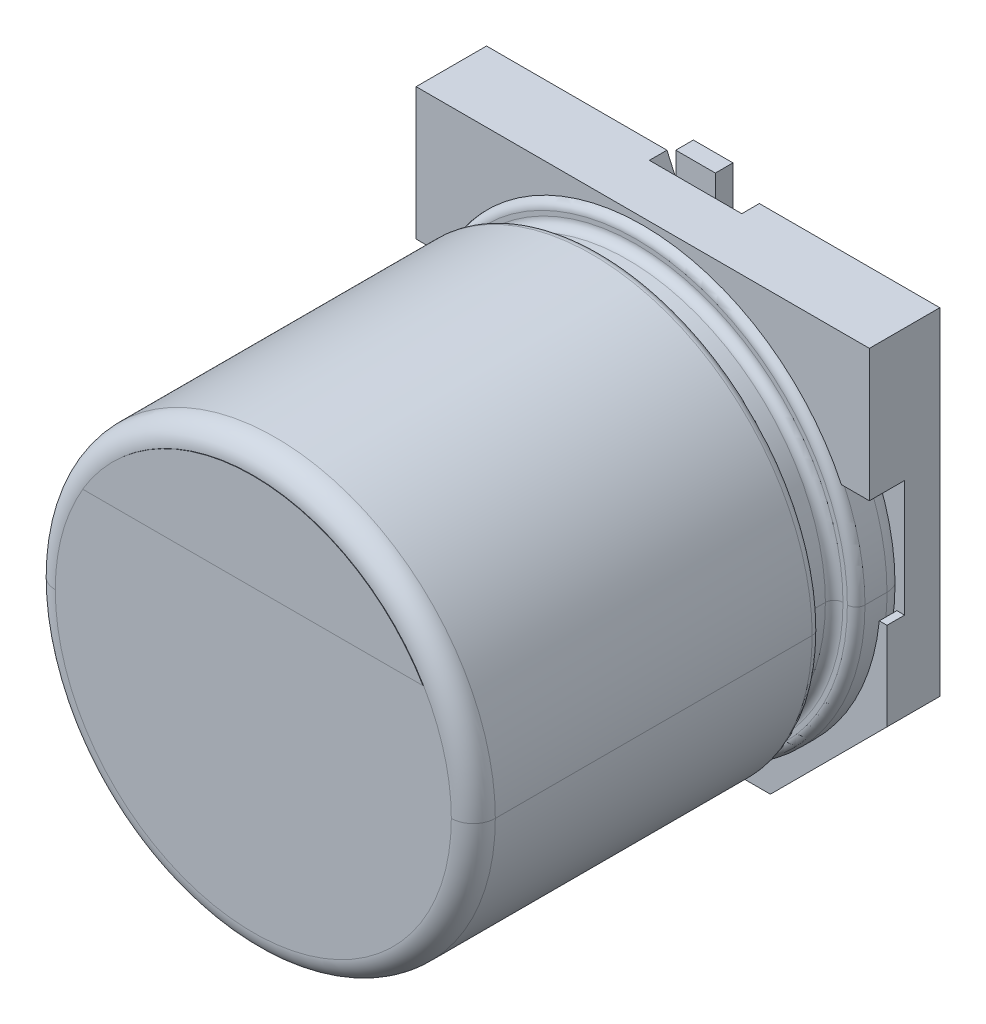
ISO-10303-21;
HEADER;
FILE_DESCRIPTION(('STEP AP214'),'2;1');
FILE_NAME('part.step','',(''),(''),'','','');
FILE_SCHEMA(('AUTOMOTIVE_DESIGN { 1 0 10303 214 1 1 1 1 }'));
ENDSEC;
DATA;
#1=APPLICATION_CONTEXT('core data for automotive mechanical design processes');
#2=APPLICATION_PROTOCOL_DEFINITION('international standard','automotive_design',2000,#1);
#3=PRODUCT_CONTEXT('',#1,'mechanical');
#4=PRODUCT('Part','Part','',(#3));
#5=PRODUCT_RELATED_PRODUCT_CATEGORY('part','',(#4));
#6=PRODUCT_DEFINITION_FORMATION('','',#4);
#7=PRODUCT_DEFINITION_CONTEXT('part definition',#1,'design');
#8=PRODUCT_DEFINITION('design','',#6,#7);
#9=PRODUCT_DEFINITION_SHAPE('','',#8);
#10=(LENGTH_UNIT() NAMED_UNIT(*) SI_UNIT(.MILLI.,.METRE.));
#11=(NAMED_UNIT(*) PLANE_ANGLE_UNIT() SI_UNIT($,.RADIAN.));
#12=(NAMED_UNIT(*) SI_UNIT($,.STERADIAN.) SOLID_ANGLE_UNIT());
#13=UNCERTAINTY_MEASURE_WITH_UNIT(LENGTH_MEASURE(1.E-05),#10,'distance_accuracy_value','');
#14=(GEOMETRIC_REPRESENTATION_CONTEXT(3) GLOBAL_UNCERTAINTY_ASSIGNED_CONTEXT((#13)) GLOBAL_UNIT_ASSIGNED_CONTEXT((#10,
#11,#12)) REPRESENTATION_CONTEXT('',''));
#15=CARTESIAN_POINT('',(0.,0.,0.));
#16=DIRECTION('',(0.,0.,1.));
#17=DIRECTION('',(1.,0.,0.));
#18=AXIS2_PLACEMENT_3D('',#15,#16,#17);
#19=CARTESIAN_POINT('',(0.,0.,7.91));
#20=DIRECTION('',(0.,0.,1.));
#21=DIRECTION('',(1.,0.,0.));
#22=AXIS2_PLACEMENT_3D('',#19,#20,#21);
#23=PLANE('',#22);
#24=DIRECTION('',(1.,0.,0.));
#25=VECTOR('',#24,1.);
#26=CARTESIAN_POINT('',(0.,2.3,7.91));
#27=LINE('',#26,#25);
#28=CARTESIAN_POINT('',(-3.867815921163,2.3,7.91));
#29=VERTEX_POINT('',#28);
#30=CARTESIAN_POINT('',(3.867815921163,2.3,7.91));
#31=VERTEX_POINT('',#30);
#32=EDGE_CURVE('E11',#29,#31,#27,.T.);
#33=ORIENTED_EDGE('',*,*,#32,.T.);
#34=CARTESIAN_POINT('',(0.,0.,7.91));
#35=DIRECTION('',(0.,0.,1.));
#36=DIRECTION('',(1.,0.,0.));
#37=AXIS2_PLACEMENT_3D('',#34,#35,#36);
#38=CIRCLE('',#37,4.5);
#39=EDGE_CURVE('E893',#31,#29,#38,.T.);
#40=ORIENTED_EDGE('',*,*,#39,.T.);
#41=EDGE_LOOP('',(#33,#40));
#42=FACE_BOUND('',#41,.T.);
#43=ADVANCED_FACE('F18',(#42),#23,.T.);
#44=CARTESIAN_POINT('',(0.,2.3,7.91));
#45=DIRECTION('',(0.,1.,0.));
#46=DIRECTION('',(1.,0.,0.));
#47=AXIS2_PLACEMENT_3D('',#44,#45,#46);
#48=PLANE('',#47);
#49=DIRECTION('',(1.,0.,0.));
#50=VECTOR('',#49,1.);
#51=CARTESIAN_POINT('',(0.,2.3,7.9));
#52=LINE('',#51,#50);
#53=CARTESIAN_POINT('',(-3.867815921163,2.3,7.9));
#54=VERTEX_POINT('',#53);
#55=CARTESIAN_POINT('',(3.867815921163,2.3,7.9));
#56=VERTEX_POINT('',#55);
#57=EDGE_CURVE('E29',#54,#56,#52,.T.);
#58=ORIENTED_EDGE('',*,*,#57,.T.);
#59=DIRECTION('',(0.,0.,-1.));
#60=VECTOR('',#59,1.);
#61=CARTESIAN_POINT('',(3.867815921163,2.3,7.91));
#62=LINE('',#61,#60);
#63=EDGE_CURVE('E993',#31,#56,#62,.T.);
#64=ORIENTED_EDGE('',*,*,#63,.F.);
#65=ORIENTED_EDGE('',*,*,#32,.F.);
#66=DIRECTION('',(0.,0.,-1.));
#67=VECTOR('',#66,1.);
#68=CARTESIAN_POINT('',(-3.867815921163,2.3,7.91));
#69=LINE('',#68,#67);
#70=EDGE_CURVE('E889',#29,#54,#69,.T.);
#71=ORIENTED_EDGE('',*,*,#70,.T.);
#72=EDGE_LOOP('',(#58,#64,#65,#71));
#73=FACE_BOUND('',#72,.T.);
#74=ADVANCED_FACE('F1565',(#73),#48,.F.);
#75=CARTESIAN_POINT('',(0.,0.,7.9));
#76=DIRECTION('',(0.,0.,1.));
#77=DIRECTION('',(1.,0.,0.));
#78=AXIS2_PLACEMENT_3D('',#75,#76,#77);
#79=PLANE('',#78);
#80=CARTESIAN_POINT('',(0.,0.,7.9));
#81=DIRECTION('',(0.,0.,1.));
#82=DIRECTION('',(1.,0.,0.));
#83=AXIS2_PLACEMENT_3D('',#80,#81,#82);
#84=CIRCLE('',#83,4.5);
#85=CARTESIAN_POINT('',(-4.5,0.,7.9));
#86=VERTEX_POINT('',#85);
#87=EDGE_CURVE('E826',#54,#86,#84,.T.);
#88=ORIENTED_EDGE('',*,*,#87,.T.);
#89=CARTESIAN_POINT('',(0.,0.,7.9));
#90=DIRECTION('',(0.,0.,1.));
#91=DIRECTION('',(1.,0.,0.));
#92=AXIS2_PLACEMENT_3D('',#89,#90,#91);
#93=CIRCLE('',#92,4.5);
#94=CARTESIAN_POINT('',(4.5,0.,7.9));
#95=VERTEX_POINT('',#94);
#96=EDGE_CURVE('E894',#86,#95,#93,.T.);
#97=ORIENTED_EDGE('',*,*,#96,.T.);
#98=CARTESIAN_POINT('',(0.,0.,7.9));
#99=DIRECTION('',(0.,0.,1.));
#100=DIRECTION('',(1.,0.,0.));
#101=AXIS2_PLACEMENT_3D('',#98,#99,#100);
#102=CIRCLE('',#101,4.5);
#103=EDGE_CURVE('E787',#95,#56,#102,.T.);
#104=ORIENTED_EDGE('',*,*,#103,.T.);
#105=ORIENTED_EDGE('',*,*,#57,.F.);
#106=EDGE_LOOP('',(#88,#97,#104,#105));
#107=FACE_BOUND('',#106,.T.);
#108=ADVANCED_FACE('F1517',(#107),#79,.T.);
#109=CARTESIAN_POINT('',(0.,0.,7.91));
#110=DIRECTION('',(0.,0.,-1.));
#111=DIRECTION('',(-1.,0.,0.));
#112=AXIS2_PLACEMENT_3D('',#109,#110,#111);
#113=CYLINDRICAL_SURFACE('',#112,4.5);
#114=CARTESIAN_POINT('',(0.,0.,7.9));
#115=DIRECTION('',(0.,0.,1.));
#116=DIRECTION('',(1.,0.,0.));
#117=AXIS2_PLACEMENT_3D('',#114,#115,#116);
#118=CIRCLE('',#117,4.5);
#119=EDGE_CURVE('E792',#56,#54,#118,.T.);
#120=ORIENTED_EDGE('',*,*,#119,.T.);
#121=ORIENTED_EDGE('',*,*,#70,.F.);
#122=ORIENTED_EDGE('',*,*,#39,.F.);
#123=ORIENTED_EDGE('',*,*,#63,.T.);
#124=EDGE_LOOP('',(#120,#121,#122,#123));
#125=FACE_BOUND('',#124,.T.);
#126=ADVANCED_FACE('F1666',(#125),#113,.T.);
#127=CARTESIAN_POINT('',(0.,0.,7.4));
#128=DIRECTION('',(0.,0.,1.));
#129=DIRECTION('',(1.,0.,0.));
#130=AXIS2_PLACEMENT_3D('',#127,#128,#129);
#131=TOROIDAL_SURFACE('',#130,4.5,0.5);
#132=CARTESIAN_POINT('',(-4.5,0.,7.4));
#133=DIRECTION('',(0.,1.,0.));
#134=DIRECTION('',(-1.,0.,0.));
#135=AXIS2_PLACEMENT_3D('',#132,#133,#134);
#136=CIRCLE('',#135,0.5);
#137=CARTESIAN_POINT('',(-5.,0.,7.4));
#138=VERTEX_POINT('',#137);
#139=EDGE_CURVE('E843',#138,#86,#136,.T.);
#140=ORIENTED_EDGE('',*,*,#139,.F.);
#141=CARTESIAN_POINT('',(0.,0.,7.4));
#142=DIRECTION('',(0.,0.,-1.));
#143=DIRECTION('',(1.,0.,0.));
#144=AXIS2_PLACEMENT_3D('',#141,#142,#143);
#145=CIRCLE('',#144,5.);
#146=CARTESIAN_POINT('',(5.,0.,7.4));
#147=VERTEX_POINT('',#146);
#148=EDGE_CURVE('E757',#147,#138,#145,.T.);
#149=ORIENTED_EDGE('',*,*,#148,.F.);
#150=CARTESIAN_POINT('',(4.5,0.,7.4));
#151=DIRECTION('',(0.,-1.,0.));
#152=DIRECTION('',(0.,0.,-1.));
#153=AXIS2_PLACEMENT_3D('',#150,#151,#152);
#154=CIRCLE('',#153,0.5);
#155=EDGE_CURVE('E791',#147,#95,#154,.T.);
#156=ORIENTED_EDGE('',*,*,#155,.T.);
#157=ORIENTED_EDGE('',*,*,#96,.F.);
#158=EDGE_LOOP('',(#140,#149,#156,#157));
#159=FACE_BOUND('',#158,.T.);
#160=ADVANCED_FACE('F1509',(#159),#131,.T.);
#161=CARTESIAN_POINT('',(0.,0.,7.4));
#162=DIRECTION('',(0.,0.,1.));
#163=DIRECTION('',(1.,0.,0.));
#164=AXIS2_PLACEMENT_3D('',#161,#162,#163);
#165=TOROIDAL_SURFACE('',#164,4.5,0.5);
#166=CARTESIAN_POINT('',(0.,0.,7.4));
#167=DIRECTION('',(0.,0.,-1.));
#168=DIRECTION('',(1.,0.,0.));
#169=AXIS2_PLACEMENT_3D('',#166,#167,#168);
#170=CIRCLE('',#169,5.);
#171=EDGE_CURVE('E691',#138,#147,#170,.T.);
#172=ORIENTED_EDGE('',*,*,#171,.F.);
#173=ORIENTED_EDGE('',*,*,#139,.T.);
#174=ORIENTED_EDGE('',*,*,#87,.F.);
#175=ORIENTED_EDGE('',*,*,#119,.F.);
#176=ORIENTED_EDGE('',*,*,#103,.F.);
#177=ORIENTED_EDGE('',*,*,#155,.F.);
#178=EDGE_LOOP('',(#172,#173,#174,#175,#176,#177));
#179=FACE_BOUND('',#178,.T.);
#180=ADVANCED_FACE('F1514',(#179),#165,.T.);
#181=CARTESIAN_POINT('',(0.,0.,7.9));
#182=DIRECTION('',(0.,0.,-1.));
#183=DIRECTION('',(-1.,0.,0.));
#184=AXIS2_PLACEMENT_3D('',#181,#182,#183);
#185=CYLINDRICAL_SURFACE('',#184,5.);
#186=DIRECTION('',(0.,0.,-1.));
#187=VECTOR('',#186,1.);
#188=CARTESIAN_POINT('',(5.,0.,7.9));
#189=LINE('',#188,#187);
#190=CARTESIAN_POINT('',(5.,0.,0.2));
#191=VERTEX_POINT('',#190);
#192=EDGE_CURVE('E686',#147,#191,#189,.T.);
#193=ORIENTED_EDGE('',*,*,#192,.F.);
#194=ORIENTED_EDGE('',*,*,#148,.T.);
#195=DIRECTION('',(0.,0.,-1.));
#196=VECTOR('',#195,1.);
#197=CARTESIAN_POINT('',(-5.,0.,7.9));
#198=LINE('',#197,#196);
#199=CARTESIAN_POINT('',(-5.,0.,0.2));
#200=VERTEX_POINT('',#199);
#201=EDGE_CURVE('E690',#138,#200,#198,.T.);
#202=ORIENTED_EDGE('',*,*,#201,.T.);
#203=CARTESIAN_POINT('',(0.,0.,0.2));
#204=DIRECTION('',(0.,0.,1.));
#205=DIRECTION('',(1.,0.,0.));
#206=AXIS2_PLACEMENT_3D('',#203,#204,#205);
#207=CIRCLE('',#206,5.);
#208=EDGE_CURVE('E754',#200,#191,#207,.T.);
#209=ORIENTED_EDGE('',*,*,#208,.T.);
#210=EDGE_LOOP('',(#193,#194,#202,#209));
#211=FACE_BOUND('',#210,.T.);
#212=ADVANCED_FACE('F1520',(#211),#185,.T.);
#213=CARTESIAN_POINT('',(0.,0.,7.9));
#214=DIRECTION('',(0.,0.,-1.));
#215=DIRECTION('',(-1.,0.,0.));
#216=AXIS2_PLACEMENT_3D('',#213,#214,#215);
#217=CYLINDRICAL_SURFACE('',#216,5.);
#218=ORIENTED_EDGE('',*,*,#171,.T.);
#219=ORIENTED_EDGE('',*,*,#192,.T.);
#220=CARTESIAN_POINT('',(0.,0.,0.2));
#221=DIRECTION('',(0.,0.,1.));
#222=DIRECTION('',(1.,0.,0.));
#223=AXIS2_PLACEMENT_3D('',#220,#221,#222);
#224=CIRCLE('',#223,5.);
#225=EDGE_CURVE('E835',#191,#200,#224,.T.);
#226=ORIENTED_EDGE('',*,*,#225,.T.);
#227=ORIENTED_EDGE('',*,*,#201,.F.);
#228=EDGE_LOOP('',(#218,#219,#226,#227));
#229=FACE_BOUND('',#228,.T.);
#230=ADVANCED_FACE('F1523',(#229),#217,.T.);
#231=CARTESIAN_POINT('',(0.,0.,0.2));
#232=DIRECTION('',(0.,0.,1.));
#233=DIRECTION('',(1.,0.,0.));
#234=AXIS2_PLACEMENT_3D('',#231,#232,#233);
#235=TOROIDAL_SURFACE('',#234,4.8,0.2);
#236=CARTESIAN_POINT('',(-4.8,0.,0.2));
#237=DIRECTION('',(0.,1.,0.));
#238=DIRECTION('',(-1.,0.,0.));
#239=AXIS2_PLACEMENT_3D('',#236,#237,#238);
#240=CIRCLE('',#239,0.2);
#241=CARTESIAN_POINT('',(-4.8,0.,0.));
#242=VERTEX_POINT('',#241);
#243=EDGE_CURVE('E660',#242,#200,#240,.T.);
#244=ORIENTED_EDGE('',*,*,#243,.F.);
#245=CARTESIAN_POINT('',(0.,0.,0.));
#246=DIRECTION('',(0.,0.,-1.));
#247=DIRECTION('',(1.,0.,0.));
#248=AXIS2_PLACEMENT_3D('',#245,#246,#247);
#249=CIRCLE('',#248,4.8);
#250=CARTESIAN_POINT('',(4.8,0.,0.));
#251=VERTEX_POINT('',#250);
#252=EDGE_CURVE('E661',#251,#242,#249,.T.);
#253=ORIENTED_EDGE('',*,*,#252,.F.);
#254=CARTESIAN_POINT('',(4.8,0.,0.2));
#255=DIRECTION('',(0.,-1.,0.));
#256=DIRECTION('',(0.,0.,-1.));
#257=AXIS2_PLACEMENT_3D('',#254,#255,#256);
#258=CIRCLE('',#257,0.2);
#259=EDGE_CURVE('E839',#251,#191,#258,.T.);
#260=ORIENTED_EDGE('',*,*,#259,.T.);
#261=ORIENTED_EDGE('',*,*,#208,.F.);
#262=EDGE_LOOP('',(#244,#253,#260,#261));
#263=FACE_BOUND('',#262,.T.);
#264=ADVANCED_FACE('F1530',(#263),#235,.T.);
#265=CARTESIAN_POINT('',(0.,0.,0.2));
#266=DIRECTION('',(0.,0.,1.));
#267=DIRECTION('',(1.,0.,0.));
#268=AXIS2_PLACEMENT_3D('',#265,#266,#267);
#269=TOROIDAL_SURFACE('',#268,4.8,0.2);
#270=CARTESIAN_POINT('',(0.,0.,0.));
#271=DIRECTION('',(0.,0.,-1.));
#272=DIRECTION('',(1.,0.,0.));
#273=AXIS2_PLACEMENT_3D('',#270,#271,#272);
#274=CIRCLE('',#273,4.8);
#275=EDGE_CURVE('E656',#242,#251,#274,.T.);
#276=ORIENTED_EDGE('',*,*,#275,.F.);
#277=ORIENTED_EDGE('',*,*,#243,.T.);
#278=ORIENTED_EDGE('',*,*,#225,.F.);
#279=ORIENTED_EDGE('',*,*,#259,.F.);
#280=EDGE_LOOP('',(#276,#277,#278,#279));
#281=FACE_BOUND('',#280,.T.);
#282=ADVANCED_FACE('F1527',(#281),#269,.T.);
#283=CARTESIAN_POINT('',(0.,0.,0.));
#284=DIRECTION('',(0.,0.,1.));
#285=DIRECTION('',(1.,0.,0.));
#286=AXIS2_PLACEMENT_3D('',#283,#284,#285);
#287=PLANE('',#286);
#288=ORIENTED_EDGE('',*,*,#252,.T.);
#289=ORIENTED_EDGE('',*,*,#275,.T.);
#290=EDGE_LOOP('',(#288,#289));
#291=FACE_BOUND('',#290,.T.);
#292=CARTESIAN_POINT('',(0.,0.,0.));
#293=DIRECTION('',(0.,0.,1.));
#294=DIRECTION('',(1.,0.,0.));
#295=AXIS2_PLACEMENT_3D('',#292,#293,#294);
#296=CIRCLE('',#295,4.7);
#297=CARTESIAN_POINT('',(4.7,0.,0.));
#298=VERTEX_POINT('',#297);
#299=CARTESIAN_POINT('',(-4.7,0.,0.));
#300=VERTEX_POINT('',#299);
#301=EDGE_CURVE('E710',#298,#300,#296,.T.);
#302=ORIENTED_EDGE('',*,*,#301,.T.);
#303=CARTESIAN_POINT('',(0.,0.,0.));
#304=DIRECTION('',(0.,0.,1.));
#305=DIRECTION('',(1.,0.,0.));
#306=AXIS2_PLACEMENT_3D('',#303,#304,#305);
#307=CIRCLE('',#306,4.7);
#308=EDGE_CURVE('E1052',#300,#298,#307,.T.);
#309=ORIENTED_EDGE('',*,*,#308,.T.);
#310=EDGE_LOOP('',(#302,#309));
#311=FACE_BOUND('',#310,.T.);
#312=ADVANCED_FACE('F1535',(#291,#311),#287,.F.);
#313=CARTESIAN_POINT('',(0.,0.,-0.2));
#314=DIRECTION('',(0.,0.,1.));
#315=DIRECTION('',(1.,0.,0.));
#316=AXIS2_PLACEMENT_3D('',#313,#314,#315);
#317=TOROIDAL_SURFACE('',#316,4.7,0.2);
#318=CARTESIAN_POINT('',(-4.7,0.,-0.2));
#319=DIRECTION('',(0.,1.,0.));
#320=DIRECTION('',(-1.,0.,0.));
#321=AXIS2_PLACEMENT_3D('',#318,#319,#320);
#322=CIRCLE('',#321,0.2);
#323=CARTESIAN_POINT('',(-4.5,0.,-0.2));
#324=VERTEX_POINT('',#323);
#325=EDGE_CURVE('E1056',#300,#324,#322,.T.);
#326=ORIENTED_EDGE('',*,*,#325,.F.);
#327=ORIENTED_EDGE('',*,*,#301,.F.);
#328=CARTESIAN_POINT('',(4.7,0.,-0.2));
#329=DIRECTION('',(0.,-1.,0.));
#330=DIRECTION('',(0.,0.,-1.));
#331=AXIS2_PLACEMENT_3D('',#328,#329,#330);
#332=CIRCLE('',#331,0.2);
#333=CARTESIAN_POINT('',(4.5,0.,-0.2));
#334=VERTEX_POINT('',#333);
#335=EDGE_CURVE('E1053',#298,#334,#332,.T.);
#336=ORIENTED_EDGE('',*,*,#335,.T.);
#337=CARTESIAN_POINT('',(0.,0.,-0.2));
#338=DIRECTION('',(0.,0.,-1.));
#339=DIRECTION('',(1.,0.,0.));
#340=AXIS2_PLACEMENT_3D('',#337,#338,#339);
#341=CIRCLE('',#340,4.5);
#342=EDGE_CURVE('E654',#324,#334,#341,.T.);
#343=ORIENTED_EDGE('',*,*,#342,.F.);
#344=EDGE_LOOP('',(#326,#327,#336,#343));
#345=FACE_BOUND('',#344,.T.);
#346=ADVANCED_FACE('F1538',(#345),#317,.F.);
#347=CARTESIAN_POINT('',(0.,0.,-0.2));
#348=DIRECTION('',(0.,0.,1.));
#349=DIRECTION('',(1.,0.,0.));
#350=AXIS2_PLACEMENT_3D('',#347,#348,#349);
#351=TOROIDAL_SURFACE('',#350,4.7,0.2);
#352=ORIENTED_EDGE('',*,*,#308,.F.);
#353=ORIENTED_EDGE('',*,*,#325,.T.);
#354=CARTESIAN_POINT('',(0.,0.,-0.2));
#355=DIRECTION('',(0.,0.,-1.));
#356=DIRECTION('',(1.,0.,0.));
#357=AXIS2_PLACEMENT_3D('',#354,#355,#356);
#358=CIRCLE('',#357,4.5);
#359=EDGE_CURVE('E650',#334,#324,#358,.T.);
#360=ORIENTED_EDGE('',*,*,#359,.F.);
#361=ORIENTED_EDGE('',*,*,#335,.F.);
#362=EDGE_LOOP('',(#352,#353,#360,#361));
#363=FACE_BOUND('',#362,.T.);
#364=ADVANCED_FACE('F1547',(#363),#351,.F.);
#365=CARTESIAN_POINT('',(0.,0.,-0.8));
#366=DIRECTION('',(0.,0.,1.));
#367=DIRECTION('',(1.,0.,0.));
#368=AXIS2_PLACEMENT_3D('',#365,#366,#367);
#369=CYLINDRICAL_SURFACE('',#368,4.5);
#370=CARTESIAN_POINT('',(0.,0.,-0.6));
#371=DIRECTION('',(0.,0.,1.));
#372=DIRECTION('',(-1.,0.,0.));
#373=AXIS2_PLACEMENT_3D('',#370,#371,#372);
#374=CIRCLE('',#373,4.5);
#375=CARTESIAN_POINT('',(4.5,0.,-0.6));
#376=VERTEX_POINT('',#375);
#377=CARTESIAN_POINT('',(-4.5,0.,-0.6));
#378=VERTEX_POINT('',#377);
#379=EDGE_CURVE('E807',#376,#378,#374,.T.);
#380=ORIENTED_EDGE('',*,*,#379,.T.);
#381=DIRECTION('',(0.,0.,1.));
#382=VECTOR('',#381,1.);
#383=CARTESIAN_POINT('',(-4.5,0.,-0.8));
#384=LINE('',#383,#382);
#385=EDGE_CURVE('E858',#378,#324,#384,.T.);
#386=ORIENTED_EDGE('',*,*,#385,.T.);
#387=ORIENTED_EDGE('',*,*,#342,.T.);
#388=DIRECTION('',(0.,0.,1.));
#389=VECTOR('',#388,1.);
#390=CARTESIAN_POINT('',(4.5,0.,-0.8));
#391=LINE('',#390,#389);
#392=EDGE_CURVE('E655',#376,#334,#391,.T.);
#393=ORIENTED_EDGE('',*,*,#392,.F.);
#394=EDGE_LOOP('',(#380,#386,#387,#393));
#395=FACE_BOUND('',#394,.T.);
#396=ADVANCED_FACE('F1549',(#395),#369,.T.);
#397=CARTESIAN_POINT('',(0.,0.,-0.8));
#398=DIRECTION('',(0.,0.,1.));
#399=DIRECTION('',(1.,0.,0.));
#400=AXIS2_PLACEMENT_3D('',#397,#398,#399);
#401=CYLINDRICAL_SURFACE('',#400,4.5);
#402=ORIENTED_EDGE('',*,*,#385,.F.);
#403=CARTESIAN_POINT('',(0.,0.,-0.6));
#404=DIRECTION('',(0.,0.,1.));
#405=DIRECTION('',(-1.,0.,0.));
#406=AXIS2_PLACEMENT_3D('',#403,#404,#405);
#407=CIRCLE('',#406,4.5);
#408=EDGE_CURVE('E1224',#378,#376,#407,.T.);
#409=ORIENTED_EDGE('',*,*,#408,.T.);
#410=ORIENTED_EDGE('',*,*,#392,.T.);
#411=ORIENTED_EDGE('',*,*,#359,.T.);
#412=EDGE_LOOP('',(#402,#409,#410,#411));
#413=FACE_BOUND('',#412,.T.);
#414=ADVANCED_FACE('F1550',(#413),#401,.T.);
#415=CARTESIAN_POINT('',(0.,2.35,-1.75));
#416=DIRECTION('',(0.,0.,-1.));
#417=DIRECTION('',(0.,-1.,0.));
#418=AXIS2_PLACEMENT_3D('',#415,#416,#417);
#419=PLANE('',#418);
#420=CARTESIAN_POINT('',(0.,2.35,-1.75));
#421=DIRECTION('',(0.,0.,-1.));
#422=DIRECTION('',(-1.,0.,0.));
#423=AXIS2_PLACEMENT_3D('',#420,#421,#422);
#424=CIRCLE('',#423,0.6);
#425=CARTESIAN_POINT('',(-0.6,2.35,-1.75));
#426=VERTEX_POINT('',#425);
#427=CARTESIAN_POINT('',(0.6,2.35,-1.75));
#428=VERTEX_POINT('',#427);
#429=EDGE_CURVE('E1080',#426,#428,#424,.T.);
#430=ORIENTED_EDGE('',*,*,#429,.T.);
#431=CARTESIAN_POINT('',(0.,2.35,-1.75));
#432=DIRECTION('',(0.,0.,-1.));
#433=DIRECTION('',(-1.,0.,0.));
#434=AXIS2_PLACEMENT_3D('',#431,#432,#433);
#435=CIRCLE('',#434,0.6);
#436=EDGE_CURVE('E613',#428,#426,#435,.T.);
#437=ORIENTED_EDGE('',*,*,#436,.T.);
#438=EDGE_LOOP('',(#430,#437));
#439=FACE_BOUND('',#438,.T.);
#440=ADVANCED_FACE('F1552',(#439),#419,.T.);
#441=CARTESIAN_POINT('',(-0.45,5.65,-2.55));
#442=DIRECTION('',(0.,0.,-1.));
#443=DIRECTION('',(0.,-1.,0.));
#444=AXIS2_PLACEMENT_3D('',#441,#442,#443);
#445=PLANE('',#444);
#446=DIRECTION('',(0.,-1.,0.));
#447=VECTOR('',#446,1.);
#448=CARTESIAN_POINT('',(0.45,2.15,-2.55));
#449=LINE('',#448,#447);
#450=CARTESIAN_POINT('',(0.45,5.65,-2.55));
#451=VERTEX_POINT('',#450);
#452=CARTESIAN_POINT('',(0.45,2.45,-2.55));
#453=VERTEX_POINT('',#452);
#454=EDGE_CURVE('E705',#451,#453,#449,.T.);
#455=ORIENTED_EDGE('',*,*,#454,.T.);
#456=DIRECTION('',(-1.,0.,0.));
#457=VECTOR('',#456,1.);
#458=CARTESIAN_POINT('',(-0.45,2.45,-2.55));
#459=LINE('',#458,#457);
#460=CARTESIAN_POINT('',(-0.45,2.45,-2.55));
#461=VERTEX_POINT('',#460);
#462=EDGE_CURVE('E862',#453,#461,#459,.T.);
#463=ORIENTED_EDGE('',*,*,#462,.T.);
#464=DIRECTION('',(0.,1.,0.));
#465=VECTOR('',#464,1.);
#466=CARTESIAN_POINT('',(-0.45,2.15,-2.55));
#467=LINE('',#466,#465);
#468=CARTESIAN_POINT('',(-0.45,5.65,-2.55));
#469=VERTEX_POINT('',#468);
#470=EDGE_CURVE('E1140',#461,#469,#467,.T.);
#471=ORIENTED_EDGE('',*,*,#470,.T.);
#472=DIRECTION('',(1.,0.,0.));
#473=VECTOR('',#472,1.);
#474=CARTESIAN_POINT('',(-0.45,5.65,-2.55));
#475=LINE('',#474,#473);
#476=EDGE_CURVE('E607',#469,#451,#475,.T.);
#477=ORIENTED_EDGE('',*,*,#476,.T.);
#478=EDGE_LOOP('',(#455,#463,#471,#477));
#479=FACE_BOUND('',#478,.T.);
#480=ADVANCED_FACE('F1435',(#479),#445,.T.);
#481=CARTESIAN_POINT('',(0.,2.15,-2.55));
#482=DIRECTION('',(0.,1.,0.));
#483=DIRECTION('',(1.,0.,0.));
#484=AXIS2_PLACEMENT_3D('',#481,#482,#483);
#485=PLANE('',#484);
#486=DIRECTION('',(0.,0.,1.));
#487=VECTOR('',#486,1.);
#488=CARTESIAN_POINT('',(-0.45,2.15,-2.55));
#489=LINE('',#488,#487);
#490=CARTESIAN_POINT('',(-0.45,2.15,-2.25));
#491=VERTEX_POINT('',#490);
#492=CARTESIAN_POINT('',(-0.45,2.15,-2.15));
#493=VERTEX_POINT('',#492);
#494=EDGE_CURVE('E1277',#491,#493,#489,.T.);
#495=ORIENTED_EDGE('',*,*,#494,.F.);
#496=DIRECTION('',(1.,0.,0.));
#497=VECTOR('',#496,1.);
#498=CARTESIAN_POINT('',(0.45,2.15,-2.25));
#499=LINE('',#498,#497);
#500=CARTESIAN_POINT('',(0.45,2.15,-2.25));
#501=VERTEX_POINT('',#500);
#502=EDGE_CURVE('E806',#491,#501,#499,.T.);
#503=ORIENTED_EDGE('',*,*,#502,.T.);
#504=DIRECTION('',(0.,0.,1.));
#505=VECTOR('',#504,1.);
#506=CARTESIAN_POINT('',(0.45,2.15,-2.55));
#507=LINE('',#506,#505);
#508=CARTESIAN_POINT('',(0.45,2.15,-2.15));
#509=VERTEX_POINT('',#508);
#510=EDGE_CURVE('E700',#501,#509,#507,.T.);
#511=ORIENTED_EDGE('',*,*,#510,.T.);
#512=DIRECTION('',(-1.,0.,0.));
#513=VECTOR('',#512,1.);
#514=CARTESIAN_POINT('',(0.,2.15,-2.15));
#515=LINE('',#514,#513);
#516=EDGE_CURVE('E803',#509,#493,#515,.T.);
#517=ORIENTED_EDGE('',*,*,#516,.T.);
#518=EDGE_LOOP('',(#495,#503,#511,#517));
#519=FACE_BOUND('',#518,.T.);
#520=ADVANCED_FACE('F1706',(#519),#485,.F.);
#521=CARTESIAN_POINT('',(-0.45,2.45,-2.25));
#522=DIRECTION('',(1.,0.,0.));
#523=DIRECTION('',(0.,0.,-1.));
#524=AXIS2_PLACEMENT_3D('',#521,#522,#523);
#525=CYLINDRICAL_SURFACE('',#524,0.3);
#526=CARTESIAN_POINT('',(0.45,2.45,-2.25));
#527=DIRECTION('',(1.,0.,0.));
#528=DIRECTION('',(0.,-1.,0.));
#529=AXIS2_PLACEMENT_3D('',#526,#527,#528);
#530=CIRCLE('',#529,0.3);
#531=EDGE_CURVE('E702',#501,#453,#530,.T.);
#532=ORIENTED_EDGE('',*,*,#531,.F.);
#533=ORIENTED_EDGE('',*,*,#502,.F.);
#534=CARTESIAN_POINT('',(-0.45,2.45,-2.25));
#535=DIRECTION('',(-1.,0.,0.));
#536=DIRECTION('',(0.,1.,0.));
#537=AXIS2_PLACEMENT_3D('',#534,#535,#536);
#538=CIRCLE('',#537,0.3);
#539=EDGE_CURVE('E980',#461,#491,#538,.T.);
#540=ORIENTED_EDGE('',*,*,#539,.F.);
#541=ORIENTED_EDGE('',*,*,#462,.F.);
#542=EDGE_LOOP('',(#532,#533,#540,#541));
#543=FACE_BOUND('',#542,.T.);
#544=ADVANCED_FACE('F1441',(#543),#525,.T.);
#545=CARTESIAN_POINT('',(-0.45,5.65,-2.15));
#546=DIRECTION('',(0.,0.,-1.));
#547=DIRECTION('',(0.,-1.,0.));
#548=AXIS2_PLACEMENT_3D('',#545,#546,#547);
#549=PLANE('',#548);
#550=DIRECTION('',(0.,-1.,0.));
#551=VECTOR('',#550,1.);
#552=CARTESIAN_POINT('',(0.45,2.15,-2.15));
#553=LINE('',#552,#551);
#554=CARTESIAN_POINT('',(0.45,2.74686269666,-2.15));
#555=VERTEX_POINT('',#554);
#556=EDGE_CURVE('E618',#555,#509,#553,.T.);
#557=ORIENTED_EDGE('',*,*,#556,.F.);
#558=CARTESIAN_POINT('',(0.,2.35,-2.15));
#559=DIRECTION('',(0.,0.,1.));
#560=DIRECTION('',(1.,0.,0.));
#561=AXIS2_PLACEMENT_3D('',#558,#559,#560);
#562=CIRCLE('',#561,0.6);
#563=CARTESIAN_POINT('',(-0.45,2.74686269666,-2.15));
#564=VERTEX_POINT('',#563);
#565=EDGE_CURVE('E612',#555,#564,#562,.T.);
#566=ORIENTED_EDGE('',*,*,#565,.T.);
#567=DIRECTION('',(0.,1.,0.));
#568=VECTOR('',#567,1.);
#569=CARTESIAN_POINT('',(-0.45,2.15,-2.15));
#570=LINE('',#569,#568);
#571=EDGE_CURVE('E1217',#493,#564,#570,.T.);
#572=ORIENTED_EDGE('',*,*,#571,.F.);
#573=ORIENTED_EDGE('',*,*,#516,.F.);
#574=EDGE_LOOP('',(#557,#566,#572,#573));
#575=FACE_BOUND('',#574,.T.);
#576=ADVANCED_FACE('F1341',(#575),#549,.F.);
#577=CARTESIAN_POINT('',(0.,0.,-0.6));
#578=DIRECTION('',(0.,0.,-1.));
#579=DIRECTION('',(-1.,0.,0.));
#580=AXIS2_PLACEMENT_3D('',#577,#578,#579);
#581=TOROIDAL_SURFACE('',#580,4.7,0.2);
#582=CARTESIAN_POINT('',(4.7,0.,-0.6));
#583=DIRECTION('',(0.,1.,0.));
#584=DIRECTION('',(-1.,0.,0.));
#585=AXIS2_PLACEMENT_3D('',#582,#583,#584);
#586=CIRCLE('',#585,0.2);
#587=CARTESIAN_POINT('',(4.7,0.,-0.8));
#588=VERTEX_POINT('',#587);
#589=EDGE_CURVE('E611',#588,#376,#586,.T.);
#590=ORIENTED_EDGE('',*,*,#589,.F.);
#591=CARTESIAN_POINT('',(0.,0.,-0.8));
#592=DIRECTION('',(0.,0.,-1.));
#593=DIRECTION('',(-1.,0.,0.));
#594=AXIS2_PLACEMENT_3D('',#591,#592,#593);
#595=CIRCLE('',#594,4.7);
#596=CARTESIAN_POINT('',(-4.7,0.,-0.8));
#597=VERTEX_POINT('',#596);
#598=EDGE_CURVE('E720',#597,#588,#595,.T.);
#599=ORIENTED_EDGE('',*,*,#598,.F.);
#600=CARTESIAN_POINT('',(-4.7,0.,-0.6));
#601=DIRECTION('',(0.,-1.,0.));
#602=DIRECTION('',(0.,0.,-1.));
#603=AXIS2_PLACEMENT_3D('',#600,#601,#602);
#604=CIRCLE('',#603,0.2);
#605=EDGE_CURVE('E1319',#597,#378,#604,.T.);
#606=ORIENTED_EDGE('',*,*,#605,.T.);
#607=ORIENTED_EDGE('',*,*,#379,.F.);
#608=EDGE_LOOP('',(#590,#599,#606,#607));
#609=FACE_BOUND('',#608,.T.);
#610=ADVANCED_FACE('F1694',(#609),#581,.F.);
#611=CARTESIAN_POINT('',(0.,0.,-0.6));
#612=DIRECTION('',(0.,0.,-1.));
#613=DIRECTION('',(-1.,0.,0.));
#614=AXIS2_PLACEMENT_3D('',#611,#612,#613);
#615=TOROIDAL_SURFACE('',#614,4.7,0.2);
#616=CARTESIAN_POINT('',(0.,0.,-0.8));
#617=DIRECTION('',(0.,0.,-1.));
#618=DIRECTION('',(-1.,0.,0.));
#619=AXIS2_PLACEMENT_3D('',#616,#617,#618);
#620=CIRCLE('',#619,4.7);
#621=EDGE_CURVE('E701',#588,#597,#620,.T.);
#622=ORIENTED_EDGE('',*,*,#621,.F.);
#623=ORIENTED_EDGE('',*,*,#589,.T.);
#624=ORIENTED_EDGE('',*,*,#408,.F.);
#625=ORIENTED_EDGE('',*,*,#605,.F.);
#626=EDGE_LOOP('',(#622,#623,#624,#625));
#627=FACE_BOUND('',#626,.T.);
#628=ADVANCED_FACE('F1584',(#627),#615,.F.);
#629=CARTESIAN_POINT('',(0.45,5.65,-2.55));
#630=DIRECTION('',(0.,-1.,0.));
#631=DIRECTION('',(0.,0.,-1.));
#632=AXIS2_PLACEMENT_3D('',#629,#630,#631);
#633=PLANE('',#632);
#634=DIRECTION('',(1.,0.,0.));
#635=VECTOR('',#634,1.);
#636=CARTESIAN_POINT('',(0.45,5.65,-2.15));
#637=LINE('',#636,#635);
#638=CARTESIAN_POINT('',(-0.45,5.65,-2.15));
#639=VERTEX_POINT('',#638);
#640=CARTESIAN_POINT('',(0.45,5.65,-2.15));
#641=VERTEX_POINT('',#640);
#642=EDGE_CURVE('E649',#639,#641,#637,.T.);
#643=ORIENTED_EDGE('',*,*,#642,.T.);
#644=DIRECTION('',(0.,0.,1.));
#645=VECTOR('',#644,1.);
#646=CARTESIAN_POINT('',(0.45,5.65,-2.55));
#647=LINE('',#646,#645);
#648=EDGE_CURVE('E782',#451,#641,#647,.T.);
#649=ORIENTED_EDGE('',*,*,#648,.F.);
#650=ORIENTED_EDGE('',*,*,#476,.F.);
#651=DIRECTION('',(0.,0.,1.));
#652=VECTOR('',#651,1.);
#653=CARTESIAN_POINT('',(-0.45,5.65,-2.55));
#654=LINE('',#653,#652);
#655=EDGE_CURVE('E1214',#469,#639,#654,.T.);
#656=ORIENTED_EDGE('',*,*,#655,.T.);
#657=EDGE_LOOP('',(#643,#649,#650,#656));
#658=FACE_BOUND('',#657,.T.);
#659=ADVANCED_FACE('F1582',(#658),#633,.F.);
#660=CARTESIAN_POINT('',(0.,2.35,-1.75));
#661=DIRECTION('',(0.,0.,-1.));
#662=DIRECTION('',(-1.,0.,0.));
#663=AXIS2_PLACEMENT_3D('',#660,#661,#662);
#664=CYLINDRICAL_SURFACE('',#663,0.6);
#665=DIRECTION('',(0.,0.,-1.));
#666=VECTOR('',#665,1.);
#667=CARTESIAN_POINT('',(0.6,2.35,-1.75));
#668=LINE('',#667,#666);
#669=CARTESIAN_POINT('',(0.6,2.35,-2.15));
#670=VERTEX_POINT('',#669);
#671=EDGE_CURVE('E617',#428,#670,#668,.T.);
#672=ORIENTED_EDGE('',*,*,#671,.F.);
#673=ORIENTED_EDGE('',*,*,#429,.F.);
#674=DIRECTION('',(0.,0.,-1.));
#675=VECTOR('',#674,1.);
#676=CARTESIAN_POINT('',(-0.6,2.35,-1.75));
#677=LINE('',#676,#675);
#678=CARTESIAN_POINT('',(-0.6,2.35,-2.15));
#679=VERTEX_POINT('',#678);
#680=EDGE_CURVE('E739',#426,#679,#677,.T.);
#681=ORIENTED_EDGE('',*,*,#680,.T.);
#682=CARTESIAN_POINT('',(0.,2.35,-2.15));
#683=DIRECTION('',(0.,0.,1.));
#684=DIRECTION('',(1.,0.,0.));
#685=AXIS2_PLACEMENT_3D('',#682,#683,#684);
#686=CIRCLE('',#685,0.6);
#687=EDGE_CURVE('E869',#564,#679,#686,.T.);
#688=ORIENTED_EDGE('',*,*,#687,.F.);
#689=ORIENTED_EDGE('',*,*,#565,.F.);
#690=CARTESIAN_POINT('',(0.,2.35,-2.15));
#691=DIRECTION('',(0.,0.,1.));
#692=DIRECTION('',(1.,0.,0.));
#693=AXIS2_PLACEMENT_3D('',#690,#691,#692);
#694=CIRCLE('',#693,0.6);
#695=EDGE_CURVE('E1177',#670,#555,#694,.T.);
#696=ORIENTED_EDGE('',*,*,#695,.F.);
#697=EDGE_LOOP('',(#672,#673,#681,#688,#689,#696));
#698=FACE_BOUND('',#697,.T.);
#699=ADVANCED_FACE('F1336',(#698),#664,.F.);
#700=CARTESIAN_POINT('',(-0.45,2.15,-2.55));
#701=DIRECTION('',(1.,0.,0.));
#702=DIRECTION('',(0.,1.,0.));
#703=AXIS2_PLACEMENT_3D('',#700,#701,#702);
#704=PLANE('',#703);
#705=ORIENTED_EDGE('',*,*,#470,.F.);
#706=ORIENTED_EDGE('',*,*,#539,.T.);
#707=ORIENTED_EDGE('',*,*,#494,.T.);
#708=ORIENTED_EDGE('',*,*,#571,.T.);
#709=DIRECTION('',(0.,1.,0.));
#710=VECTOR('',#709,1.);
#711=CARTESIAN_POINT('',(-0.45,2.15,-2.15));
#712=LINE('',#711,#710);
#713=CARTESIAN_POINT('',(-0.45,5.15,-2.15));
#714=VERTEX_POINT('',#713);
#715=EDGE_CURVE('E865',#564,#714,#712,.T.);
#716=ORIENTED_EDGE('',*,*,#715,.T.);
#717=DIRECTION('',(0.,1.,0.));
#718=VECTOR('',#717,1.);
#719=CARTESIAN_POINT('',(-0.45,2.15,-2.15));
#720=LINE('',#719,#718);
#721=EDGE_CURVE('E884',#714,#639,#720,.T.);
#722=ORIENTED_EDGE('',*,*,#721,.T.);
#723=ORIENTED_EDGE('',*,*,#655,.F.);
#724=EDGE_LOOP('',(#705,#706,#707,#708,#716,#722,#723));
#725=FACE_BOUND('',#724,.T.);
#726=ADVANCED_FACE('F1446',(#725),#704,.F.);
#727=CARTESIAN_POINT('',(0.,2.35,-1.75));
#728=DIRECTION('',(0.,0.,-1.));
#729=DIRECTION('',(-1.,0.,0.));
#730=AXIS2_PLACEMENT_3D('',#727,#728,#729);
#731=CYLINDRICAL_SURFACE('',#730,0.6);
#732=ORIENTED_EDGE('',*,*,#436,.F.);
#733=ORIENTED_EDGE('',*,*,#671,.T.);
#734=CARTESIAN_POINT('',(0.,2.35,-2.15));
#735=DIRECTION('',(0.,0.,1.));
#736=DIRECTION('',(1.,0.,0.));
#737=AXIS2_PLACEMENT_3D('',#734,#735,#736);
#738=CIRCLE('',#737,0.6);
#739=EDGE_CURVE('E1181',#679,#670,#738,.T.);
#740=ORIENTED_EDGE('',*,*,#739,.F.);
#741=ORIENTED_EDGE('',*,*,#680,.F.);
#742=EDGE_LOOP('',(#732,#733,#740,#741));
#743=FACE_BOUND('',#742,.T.);
#744=ADVANCED_FACE('F1333',(#743),#731,.F.);
#745=CARTESIAN_POINT('',(0.45,2.15,-2.55));
#746=DIRECTION('',(-1.,0.,0.));
#747=DIRECTION('',(0.,1.,0.));
#748=AXIS2_PLACEMENT_3D('',#745,#746,#747);
#749=PLANE('',#748);
#750=ORIENTED_EDGE('',*,*,#510,.F.);
#751=ORIENTED_EDGE('',*,*,#531,.T.);
#752=ORIENTED_EDGE('',*,*,#454,.F.);
#753=ORIENTED_EDGE('',*,*,#648,.T.);
#754=DIRECTION('',(0.,-1.,0.));
#755=VECTOR('',#754,1.);
#756=CARTESIAN_POINT('',(0.45,2.15,-2.15));
#757=LINE('',#756,#755);
#758=CARTESIAN_POINT('',(0.45,5.15,-2.15));
#759=VERTEX_POINT('',#758);
#760=EDGE_CURVE('E882',#641,#759,#757,.T.);
#761=ORIENTED_EDGE('',*,*,#760,.T.);
#762=DIRECTION('',(0.,-1.,0.));
#763=VECTOR('',#762,1.);
#764=CARTESIAN_POINT('',(0.45,2.15,-2.15));
#765=LINE('',#764,#763);
#766=EDGE_CURVE('E1035',#759,#555,#765,.T.);
#767=ORIENTED_EDGE('',*,*,#766,.T.);
#768=ORIENTED_EDGE('',*,*,#556,.T.);
#769=EDGE_LOOP('',(#750,#751,#752,#753,#761,#767,#768));
#770=FACE_BOUND('',#769,.T.);
#771=ADVANCED_FACE('F1344',(#770),#749,.F.);
#772=CARTESIAN_POINT('',(0.,0.,-1.));
#773=DIRECTION('',(0.,0.,-1.));
#774=DIRECTION('',(-1.,0.,0.));
#775=AXIS2_PLACEMENT_3D('',#772,#773,#774);
#776=TOROIDAL_SURFACE('',#775,4.8,0.2);
#777=CARTESIAN_POINT('',(0.,0.,-0.8));
#778=DIRECTION('',(0.,0.,1.));
#779=DIRECTION('',(-1.,0.,0.));
#780=AXIS2_PLACEMENT_3D('',#777,#778,#779);
#781=CIRCLE('',#780,4.8);
#782=CARTESIAN_POINT('',(4.8,0.,-0.8));
#783=VERTEX_POINT('',#782);
#784=CARTESIAN_POINT('',(-4.8,0.,-0.8));
#785=VERTEX_POINT('',#784);
#786=EDGE_CURVE('E697',#783,#785,#781,.T.);
#787=ORIENTED_EDGE('',*,*,#786,.F.);
#788=CARTESIAN_POINT('',(4.8,0.,-1.));
#789=DIRECTION('',(0.,1.,0.));
#790=DIRECTION('',(-1.,0.,0.));
#791=AXIS2_PLACEMENT_3D('',#788,#789,#790);
#792=CIRCLE('',#791,0.2);
#793=CARTESIAN_POINT('',(5.,0.,-1.));
#794=VERTEX_POINT('',#793);
#795=EDGE_CURVE('E774',#783,#794,#792,.T.);
#796=ORIENTED_EDGE('',*,*,#795,.T.);
#797=CARTESIAN_POINT('',(0.,0.,-1.));
#798=DIRECTION('',(0.,0.,-1.));
#799=DIRECTION('',(-1.,0.,0.));
#800=AXIS2_PLACEMENT_3D('',#797,#798,#799);
#801=CIRCLE('',#800,5.);
#802=CARTESIAN_POINT('',(4.514144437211,2.15,-1.));
#803=VERTEX_POINT('',#802);
#804=EDGE_CURVE('E1066',#803,#794,#801,.T.);
#805=ORIENTED_EDGE('',*,*,#804,.F.);
#806=CARTESIAN_POINT('',(0.,0.,-1.));
#807=DIRECTION('',(0.,0.,-1.));
#808=DIRECTION('',(-1.,0.,0.));
#809=AXIS2_PLACEMENT_3D('',#806,#807,#808);
#810=CIRCLE('',#809,5.);
#811=CARTESIAN_POINT('',(-4.514144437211,2.15,-1.));
#812=VERTEX_POINT('',#811);
#813=EDGE_CURVE('E645',#812,#803,#810,.T.);
#814=ORIENTED_EDGE('',*,*,#813,.F.);
#815=CARTESIAN_POINT('',(0.,0.,-1.));
#816=DIRECTION('',(0.,0.,-1.));
#817=DIRECTION('',(-1.,0.,0.));
#818=AXIS2_PLACEMENT_3D('',#815,#816,#817);
#819=CIRCLE('',#818,5.);
#820=CARTESIAN_POINT('',(-5.,0.,-1.));
#821=VERTEX_POINT('',#820);
#822=EDGE_CURVE('E870',#821,#812,#819,.T.);
#823=ORIENTED_EDGE('',*,*,#822,.F.);
#824=CARTESIAN_POINT('',(-4.8,0.,-1.));
#825=DIRECTION('',(0.,-1.,0.));
#826=DIRECTION('',(0.,0.,-1.));
#827=AXIS2_PLACEMENT_3D('',#824,#825,#826);
#828=CIRCLE('',#827,0.2);
#829=EDGE_CURVE('E773',#785,#821,#828,.T.);
#830=ORIENTED_EDGE('',*,*,#829,.F.);
#831=EDGE_LOOP('',(#787,#796,#805,#814,#823,#830));
#832=FACE_BOUND('',#831,.T.);
#833=ADVANCED_FACE('F1592',(#832),#776,.T.);
#834=CARTESIAN_POINT('',(0.,0.,-0.8));
#835=DIRECTION('',(0.,0.,-1.));
#836=DIRECTION('',(0.,-1.,0.));
#837=AXIS2_PLACEMENT_3D('',#834,#835,#836);
#838=PLANE('',#837);
#839=CARTESIAN_POINT('',(0.,0.,-0.8));
#840=DIRECTION('',(0.,0.,1.));
#841=DIRECTION('',(-1.,0.,0.));
#842=AXIS2_PLACEMENT_3D('',#839,#840,#841);
#843=CIRCLE('',#842,4.8);
#844=EDGE_CURVE('E769',#785,#783,#843,.T.);
#845=ORIENTED_EDGE('',*,*,#844,.T.);
#846=ORIENTED_EDGE('',*,*,#786,.T.);
#847=EDGE_LOOP('',(#845,#846));
#848=FACE_BOUND('',#847,.T.);
#849=ORIENTED_EDGE('',*,*,#598,.T.);
#850=ORIENTED_EDGE('',*,*,#621,.T.);
#851=EDGE_LOOP('',(#849,#850));
#852=FACE_BOUND('',#851,.T.);
#853=ADVANCED_FACE('F20',(#848,#852),#838,.F.);
#854=CARTESIAN_POINT('',(0.,0.,-1.5));
#855=DIRECTION('',(0.,0.,-1.));
#856=DIRECTION('',(-1.,0.,0.));
#857=AXIS2_PLACEMENT_3D('',#854,#855,#856);
#858=TOROIDAL_SURFACE('',#857,4.5,0.5);
#859=CARTESIAN_POINT('',(0.,0.,-1.5));
#860=DIRECTION('',(0.,0.,1.));
#861=DIRECTION('',(-1.,0.,0.));
#862=AXIS2_PLACEMENT_3D('',#859,#860,#861);
#863=CIRCLE('',#862,5.);
#864=CARTESIAN_POINT('',(5.,0.,-1.5));
#865=VERTEX_POINT('',#864);
#866=CARTESIAN_POINT('',(4.514144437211,2.15,-1.5));
#867=VERTEX_POINT('',#866);
#868=EDGE_CURVE('E1069',#865,#867,#863,.T.);
#869=ORIENTED_EDGE('',*,*,#868,.F.);
#870=CARTESIAN_POINT('',(4.5,0.,-1.5));
#871=DIRECTION('',(0.,1.,0.));
#872=DIRECTION('',(-1.,0.,0.));
#873=AXIS2_PLACEMENT_3D('',#870,#871,#872);
#874=CIRCLE('',#873,0.5);
#875=CARTESIAN_POINT('',(4.933012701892,0.,-1.75));
#876=VERTEX_POINT('',#875);
#877=EDGE_CURVE('E1027',#865,#876,#874,.T.);
#878=ORIENTED_EDGE('',*,*,#877,.T.);
#879=CARTESIAN_POINT('',(0.,0.,-1.75));
#880=DIRECTION('',(0.,0.,1.));
#881=DIRECTION('',(-1.,0.,0.));
#882=AXIS2_PLACEMENT_3D('',#879,#880,#881);
#883=CIRCLE('',#882,4.933012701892);
#884=CARTESIAN_POINT('',(-4.933012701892,0.,-1.75));
#885=VERTEX_POINT('',#884);
#886=EDGE_CURVE('E1009',#876,#885,#883,.T.);
#887=ORIENTED_EDGE('',*,*,#886,.T.);
#888=CARTESIAN_POINT('',(-4.5,0.,-1.5));
#889=DIRECTION('',(0.,-1.,0.));
#890=DIRECTION('',(0.,0.,-1.));
#891=AXIS2_PLACEMENT_3D('',#888,#889,#890);
#892=CIRCLE('',#891,0.5);
#893=CARTESIAN_POINT('',(-5.,0.,-1.5));
#894=VERTEX_POINT('',#893);
#895=EDGE_CURVE('E1031',#894,#885,#892,.T.);
#896=ORIENTED_EDGE('',*,*,#895,.F.);
#897=CARTESIAN_POINT('',(0.,0.,-1.5));
#898=DIRECTION('',(0.,0.,1.));
#899=DIRECTION('',(-1.,0.,0.));
#900=AXIS2_PLACEMENT_3D('',#897,#898,#899);
#901=CIRCLE('',#900,5.);
#902=CARTESIAN_POINT('',(-4.514144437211,2.15,-1.5));
#903=VERTEX_POINT('',#902);
#904=EDGE_CURVE('E1048',#903,#894,#901,.T.);
#905=ORIENTED_EDGE('',*,*,#904,.F.);
#906=CARTESIAN_POINT('',(0.,0.,-1.5));
#907=DIRECTION('',(0.,0.,1.));
#908=DIRECTION('',(-1.,0.,0.));
#909=AXIS2_PLACEMENT_3D('',#906,#907,#908);
#910=CIRCLE('',#909,5.);
#911=EDGE_CURVE('E648',#867,#903,#910,.T.);
#912=ORIENTED_EDGE('',*,*,#911,.F.);
#913=EDGE_LOOP('',(#869,#878,#887,#896,#905,#912));
#914=FACE_BOUND('',#913,.T.);
#915=ADVANCED_FACE('F1633',(#914),#858,.T.);
#916=CARTESIAN_POINT('',(0.,0.,-0.95));
#917=DIRECTION('',(0.,0.,-1.));
#918=DIRECTION('',(-1.,0.,0.));
#919=AXIS2_PLACEMENT_3D('',#916,#917,#918);
#920=CYLINDRICAL_SURFACE('',#919,5.);
#921=DIRECTION('',(0.,0.,-1.));
#922=VECTOR('',#921,1.);
#923=CARTESIAN_POINT('',(4.514144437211,2.15,-0.95));
#924=LINE('',#923,#922);
#925=CARTESIAN_POINT('',(4.514144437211,2.15,-1.75));
#926=VERTEX_POINT('',#925);
#927=EDGE_CURVE('E624',#867,#926,#924,.T.);
#928=ORIENTED_EDGE('',*,*,#927,.F.);
#929=ORIENTED_EDGE('',*,*,#911,.T.);
#930=DIRECTION('',(0.,0.,-1.));
#931=VECTOR('',#930,1.);
#932=CARTESIAN_POINT('',(-4.514144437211,2.15,-0.95));
#933=LINE('',#932,#931);
#934=CARTESIAN_POINT('',(-4.514144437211,2.15,-1.75));
#935=VERTEX_POINT('',#934);
#936=EDGE_CURVE('E733',#903,#935,#933,.T.);
#937=ORIENTED_EDGE('',*,*,#936,.T.);
#938=CARTESIAN_POINT('',(0.,0.,-1.75));
#939=DIRECTION('',(0.,0.,-1.));
#940=DIRECTION('',(1.,0.,0.));
#941=AXIS2_PLACEMENT_3D('',#938,#939,#940);
#942=CIRCLE('',#941,5.);
#943=EDGE_CURVE('E1013',#935,#926,#942,.T.);
#944=ORIENTED_EDGE('',*,*,#943,.T.);
#945=EDGE_LOOP('',(#928,#929,#937,#944));
#946=FACE_BOUND('',#945,.T.);
#947=ADVANCED_FACE('F1636',(#946),#920,.F.);
#948=CARTESIAN_POINT('',(0.,0.,-0.95));
#949=DIRECTION('',(0.,0.,-1.));
#950=DIRECTION('',(-1.,0.,0.));
#951=AXIS2_PLACEMENT_3D('',#948,#949,#950);
#952=CYLINDRICAL_SURFACE('',#951,5.);
#953=ORIENTED_EDGE('',*,*,#813,.T.);
#954=DIRECTION('',(0.,0.,-1.));
#955=VECTOR('',#954,1.);
#956=CARTESIAN_POINT('',(4.514144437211,2.15,-0.95));
#957=LINE('',#956,#955);
#958=CARTESIAN_POINT('',(4.514144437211,2.15,-0.95));
#959=VERTEX_POINT('',#958);
#960=EDGE_CURVE('E721',#959,#803,#957,.T.);
#961=ORIENTED_EDGE('',*,*,#960,.F.);
#962=CARTESIAN_POINT('',(0.,0.,-0.95));
#963=DIRECTION('',(0.,0.,-1.));
#964=DIRECTION('',(1.,0.,0.));
#965=AXIS2_PLACEMENT_3D('',#962,#963,#964);
#966=CIRCLE('',#965,5.);
#967=CARTESIAN_POINT('',(-4.514144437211,2.15,-0.95));
#968=VERTEX_POINT('',#967);
#969=EDGE_CURVE('E623',#968,#959,#966,.T.);
#970=ORIENTED_EDGE('',*,*,#969,.F.);
#971=DIRECTION('',(0.,0.,-1.));
#972=VECTOR('',#971,1.);
#973=CARTESIAN_POINT('',(-4.514144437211,2.15,-0.95));
#974=LINE('',#973,#972);
#975=EDGE_CURVE('E1019',#968,#812,#974,.T.);
#976=ORIENTED_EDGE('',*,*,#975,.T.);
#977=EDGE_LOOP('',(#953,#961,#970,#976));
#978=FACE_BOUND('',#977,.T.);
#979=ADVANCED_FACE('F1640',(#978),#952,.F.);
#980=CARTESIAN_POINT('',(-0.45,5.65,-2.15));
#981=DIRECTION('',(0.,0.,-1.));
#982=DIRECTION('',(0.,-1.,0.));
#983=AXIS2_PLACEMENT_3D('',#980,#981,#982);
#984=PLANE('',#983);
#985=ORIENTED_EDGE('',*,*,#721,.F.);
#986=DIRECTION('',(1.,0.,0.));
#987=VECTOR('',#986,1.);
#988=CARTESIAN_POINT('',(2.5,5.15,-2.15));
#989=LINE('',#988,#987);
#990=EDGE_CURVE('E971',#714,#759,#989,.T.);
#991=ORIENTED_EDGE('',*,*,#990,.T.);
#992=ORIENTED_EDGE('',*,*,#760,.F.);
#993=ORIENTED_EDGE('',*,*,#642,.F.);
#994=EDGE_LOOP('',(#985,#991,#992,#993));
#995=FACE_BOUND('',#994,.T.);
#996=ADVANCED_FACE('F1348',(#995),#984,.F.);
#997=CARTESIAN_POINT('',(1.608618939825,3.954518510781,-2.15));
#998=DIRECTION('',(0.,0.,1.));
#999=DIRECTION('',(1.,0.,0.));
#1000=AXIS2_PLACEMENT_3D('',#997,#998,#999);
#1001=PLANE('',#1000);
#1002=ORIENTED_EDGE('',*,*,#715,.F.);
#1003=ORIENTED_EDGE('',*,*,#687,.T.);
#1004=ORIENTED_EDGE('',*,*,#739,.T.);
#1005=ORIENTED_EDGE('',*,*,#695,.T.);
#1006=ORIENTED_EDGE('',*,*,#766,.F.);
#1007=DIRECTION('',(1.,0.,0.));
#1008=VECTOR('',#1007,1.);
#1009=CARTESIAN_POINT('',(-1.05,5.15,-2.15));
#1010=LINE('',#1009,#1008);
#1011=CARTESIAN_POINT('',(1.05,5.15,-2.15));
#1012=VERTEX_POINT('',#1011);
#1013=EDGE_CURVE('E948',#759,#1012,#1010,.T.);
#1014=ORIENTED_EDGE('',*,*,#1013,.T.);
#1015=DIRECTION('',(-0.410364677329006,-0.911921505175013,0.));
#1016=VECTOR('',#1015,1.);
#1017=CARTESIAN_POINT('',(0.696697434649,4.36488318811,-2.15));
#1018=LINE('',#1017,#1016);
#1019=CARTESIAN_POINT('',(0.696697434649,4.36488318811,-2.15));
#1020=VERTEX_POINT('',#1019);
#1021=EDGE_CURVE('E569',#1012,#1020,#1018,.T.);
#1022=ORIENTED_EDGE('',*,*,#1021,.T.);
#1023=CARTESIAN_POINT('',(1.608618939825,3.954518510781,-2.15));
#1024=DIRECTION('',(0.,0.,1.));
#1025=DIRECTION('',(1.,0.,0.));
#1026=AXIS2_PLACEMENT_3D('',#1023,#1024,#1025);
#1027=CIRCLE('',#1026,1.);
#1028=CARTESIAN_POINT('',(0.608618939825,3.954518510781,-2.15));
#1029=VERTEX_POINT('',#1028);
#1030=EDGE_CURVE('E593',#1020,#1029,#1027,.T.);
#1031=ORIENTED_EDGE('',*,*,#1030,.T.);
#1032=CARTESIAN_POINT('',(1.608618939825,3.954518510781,-2.15));
#1033=DIRECTION('',(0.,0.,1.));
#1034=DIRECTION('',(1.,0.,0.));
#1035=AXIS2_PLACEMENT_3D('',#1032,#1033,#1034);
#1036=CIRCLE('',#1035,1.);
#1037=CARTESIAN_POINT('',(0.608979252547,3.927676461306,-2.15));
#1038=VERTEX_POINT('',#1037);
#1039=EDGE_CURVE('E601',#1029,#1038,#1036,.T.);
#1040=ORIENTED_EDGE('',*,*,#1039,.T.);
#1041=DIRECTION('',(0.02684204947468,-0.99963968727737,0.));
#1042=VECTOR('',#1041,1.);
#1043=CARTESIAN_POINT('',(0.65,2.4,-2.15));
#1044=LINE('',#1043,#1042);
#1045=CARTESIAN_POINT('',(0.65,2.4,-2.15));
#1046=VERTEX_POINT('',#1045);
#1047=EDGE_CURVE('E922',#1038,#1046,#1044,.T.);
#1048=ORIENTED_EDGE('',*,*,#1047,.T.);
#1049=CARTESIAN_POINT('',(0.,2.35,-2.15));
#1050=DIRECTION('',(0.,0.,-1.));
#1051=DIRECTION('',(-1.,0.,0.));
#1052=AXIS2_PLACEMENT_3D('',#1049,#1050,#1051);
#1053=CIRCLE('',#1052,0.65192024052);
#1054=CARTESIAN_POINT('',(0.65192024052,2.35,-2.15));
#1055=VERTEX_POINT('',#1054);
#1056=EDGE_CURVE('E536',#1046,#1055,#1053,.T.);
#1057=ORIENTED_EDGE('',*,*,#1056,.T.);
#1058=CARTESIAN_POINT('',(0.,2.35,-2.15));
#1059=DIRECTION('',(0.,0.,-1.));
#1060=DIRECTION('',(-1.,0.,0.));
#1061=AXIS2_PLACEMENT_3D('',#1058,#1059,#1060);
#1062=CIRCLE('',#1061,0.65192024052);
#1063=CARTESIAN_POINT('',(-0.65192024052,2.35,-2.15));
#1064=VERTEX_POINT('',#1063);
#1065=EDGE_CURVE('E531',#1055,#1064,#1062,.T.);
#1066=ORIENTED_EDGE('',*,*,#1065,.T.);
#1067=CARTESIAN_POINT('',(0.,2.35,-2.15));
#1068=DIRECTION('',(0.,0.,-1.));
#1069=DIRECTION('',(-1.,0.,0.));
#1070=AXIS2_PLACEMENT_3D('',#1067,#1068,#1069);
#1071=CIRCLE('',#1070,0.65192024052);
#1072=CARTESIAN_POINT('',(-0.65,2.4,-2.15));
#1073=VERTEX_POINT('',#1072);
#1074=EDGE_CURVE('E692',#1064,#1073,#1071,.T.);
#1075=ORIENTED_EDGE('',*,*,#1074,.T.);
#1076=DIRECTION('',(0.02684204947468,0.99963968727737,0.));
#1077=VECTOR('',#1076,1.);
#1078=CARTESIAN_POINT('',(-0.65,2.4,-2.15));
#1079=LINE('',#1078,#1077);
#1080=CARTESIAN_POINT('',(-0.608979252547,3.927676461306,-2.15));
#1081=VERTEX_POINT('',#1080);
#1082=EDGE_CURVE('E1125',#1073,#1081,#1079,.T.);
#1083=ORIENTED_EDGE('',*,*,#1082,.T.);
#1084=CARTESIAN_POINT('',(-1.608618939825,3.954518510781,-2.15));
#1085=DIRECTION('',(0.,0.,1.));
#1086=DIRECTION('',(-1.,0.,0.));
#1087=AXIS2_PLACEMENT_3D('',#1084,#1085,#1086);
#1088=CIRCLE('',#1087,1.);
#1089=CARTESIAN_POINT('',(-0.696697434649,4.36488318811,-2.15));
#1090=VERTEX_POINT('',#1089);
#1091=EDGE_CURVE('E638',#1081,#1090,#1088,.T.);
#1092=ORIENTED_EDGE('',*,*,#1091,.T.);
#1093=DIRECTION('',(-0.410364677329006,0.911921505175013,0.));
#1094=VECTOR('',#1093,1.);
#1095=CARTESIAN_POINT('',(-0.696697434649,4.36488318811,-2.15));
#1096=LINE('',#1095,#1094);
#1097=CARTESIAN_POINT('',(-1.05,5.15,-2.15));
#1098=VERTEX_POINT('',#1097);
#1099=EDGE_CURVE('E566',#1090,#1098,#1096,.T.);
#1100=ORIENTED_EDGE('',*,*,#1099,.T.);
#1101=DIRECTION('',(1.,0.,0.));
#1102=VECTOR('',#1101,1.);
#1103=CARTESIAN_POINT('',(-1.05,5.15,-2.15));
#1104=LINE('',#1103,#1102);
#1105=EDGE_CURVE('E587',#1098,#714,#1104,.T.);
#1106=ORIENTED_EDGE('',*,*,#1105,.T.);
#1107=EDGE_LOOP('',(#1002,#1003,#1004,#1005,#1006,#1014,#1022,#1031,#1040,#1048,#1057,#1066,
#1075,#1083,#1092,#1100,#1106));
#1108=FACE_BOUND('',#1107,.T.);
#1109=ADVANCED_FACE('F942',(#1108),#1001,.F.);
#1110=CARTESIAN_POINT('',(0.,0.,-2.));
#1111=DIRECTION('',(0.,0.,1.));
#1112=DIRECTION('',(1.,0.,0.));
#1113=AXIS2_PLACEMENT_3D('',#1110,#1111,#1112);
#1114=CYLINDRICAL_SURFACE('',#1113,5.);
#1115=ORIENTED_EDGE('',*,*,#904,.T.);
#1116=DIRECTION('',(0.,0.,1.));
#1117=VECTOR('',#1116,1.);
#1118=CARTESIAN_POINT('',(-5.,0.,-2.));
#1119=LINE('',#1118,#1117);
#1120=EDGE_CURVE('E1146',#894,#821,#1119,.T.);
#1121=ORIENTED_EDGE('',*,*,#1120,.T.);
#1122=ORIENTED_EDGE('',*,*,#822,.T.);
#1123=DIRECTION('',(0.,0.,-1.));
#1124=VECTOR('',#1123,1.);
#1125=CARTESIAN_POINT('',(-4.514144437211,2.15,-0.95));
#1126=LINE('',#1125,#1124);
#1127=EDGE_CURVE('E564',#812,#903,#1126,.T.);
#1128=ORIENTED_EDGE('',*,*,#1127,.T.);
#1129=EDGE_LOOP('',(#1115,#1121,#1122,#1128));
#1130=FACE_BOUND('',#1129,.T.);
#1131=ADVANCED_FACE('F1678',(#1130),#1114,.T.);
#1132=CARTESIAN_POINT('',(0.,0.,-2.));
#1133=DIRECTION('',(0.,0.,1.));
#1134=DIRECTION('',(1.,0.,0.));
#1135=AXIS2_PLACEMENT_3D('',#1132,#1133,#1134);
#1136=CYLINDRICAL_SURFACE('',#1135,5.);
#1137=DIRECTION('',(0.,0.,1.));
#1138=VECTOR('',#1137,1.);
#1139=CARTESIAN_POINT('',(5.,0.,-2.));
#1140=LINE('',#1139,#1138);
#1141=EDGE_CURVE('E727',#865,#794,#1140,.T.);
#1142=ORIENTED_EDGE('',*,*,#1141,.F.);
#1143=ORIENTED_EDGE('',*,*,#868,.T.);
#1144=DIRECTION('',(0.,0.,-1.));
#1145=VECTOR('',#1144,1.);
#1146=CARTESIAN_POINT('',(4.514144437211,2.15,-0.95));
#1147=LINE('',#1146,#1145);
#1148=EDGE_CURVE('E725',#803,#867,#1147,.T.);
#1149=ORIENTED_EDGE('',*,*,#1148,.F.);
#1150=ORIENTED_EDGE('',*,*,#804,.T.);
#1151=EDGE_LOOP('',(#1142,#1143,#1149,#1150));
#1152=FACE_BOUND('',#1151,.T.);
#1153=ADVANCED_FACE('F1671',(#1152),#1136,.T.);
#1154=CARTESIAN_POINT('',(0.,0.,-1.5));
#1155=DIRECTION('',(0.,0.,-1.));
#1156=DIRECTION('',(-1.,0.,0.));
#1157=AXIS2_PLACEMENT_3D('',#1154,#1155,#1156);
#1158=TOROIDAL_SURFACE('',#1157,4.5,0.5);
#1159=ORIENTED_EDGE('',*,*,#877,.F.);
#1160=CARTESIAN_POINT('',(0.,0.,-1.5));
#1161=DIRECTION('',(0.,0.,1.));
#1162=DIRECTION('',(-1.,0.,0.));
#1163=AXIS2_PLACEMENT_3D('',#1160,#1161,#1162);
#1164=CIRCLE('',#1163,5.);
#1165=CARTESIAN_POINT('',(4.974937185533,-0.5,-1.5));
#1166=VERTEX_POINT('',#1165);
#1167=EDGE_CURVE('E732',#1166,#865,#1164,.T.);
#1168=ORIENTED_EDGE('',*,*,#1167,.F.);
#1169=CARTESIAN_POINT('',(0.,0.,-1.5));
#1170=DIRECTION('',(0.,0.,1.));
#1171=DIRECTION('',(-1.,0.,0.));
#1172=AXIS2_PLACEMENT_3D('',#1169,#1170,#1171);
#1173=CIRCLE('',#1172,5.);
#1174=CARTESIAN_POINT('',(-4.974937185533,-0.5,-1.5));
#1175=VERTEX_POINT('',#1174);
#1176=EDGE_CURVE('E1015',#1175,#1166,#1173,.T.);
#1177=ORIENTED_EDGE('',*,*,#1176,.F.);
#1178=CARTESIAN_POINT('',(0.,0.,-1.5));
#1179=DIRECTION('',(0.,0.,1.));
#1180=DIRECTION('',(-1.,0.,0.));
#1181=AXIS2_PLACEMENT_3D('',#1178,#1179,#1180);
#1182=CIRCLE('',#1181,5.);
#1183=EDGE_CURVE('E1162',#894,#1175,#1182,.T.);
#1184=ORIENTED_EDGE('',*,*,#1183,.F.);
#1185=ORIENTED_EDGE('',*,*,#895,.T.);
#1186=CARTESIAN_POINT('',(0.,0.,-1.75));
#1187=DIRECTION('',(0.,0.,1.));
#1188=DIRECTION('',(-1.,0.,0.));
#1189=AXIS2_PLACEMENT_3D('',#1186,#1187,#1188);
#1190=CIRCLE('',#1189,4.933012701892);
#1191=EDGE_CURVE('E1014',#885,#876,#1190,.T.);
#1192=ORIENTED_EDGE('',*,*,#1191,.T.);
#1193=EDGE_LOOP('',(#1159,#1168,#1177,#1184,#1185,#1192));
#1194=FACE_BOUND('',#1193,.T.);
#1195=ADVANCED_FACE('F1657',(#1194),#1158,.T.);
#1196=CARTESIAN_POINT('',(0.,0.,-1.));
#1197=DIRECTION('',(0.,0.,-1.));
#1198=DIRECTION('',(-1.,0.,0.));
#1199=AXIS2_PLACEMENT_3D('',#1196,#1197,#1198);
#1200=TOROIDAL_SURFACE('',#1199,4.8,0.2);
#1201=ORIENTED_EDGE('',*,*,#795,.F.);
#1202=ORIENTED_EDGE('',*,*,#844,.F.);
#1203=ORIENTED_EDGE('',*,*,#829,.T.);
#1204=CARTESIAN_POINT('',(0.,0.,-1.));
#1205=DIRECTION('',(0.,0.,-1.));
#1206=DIRECTION('',(-1.,0.,0.));
#1207=AXIS2_PLACEMENT_3D('',#1204,#1205,#1206);
#1208=CIRCLE('',#1207,5.);
#1209=EDGE_CURVE('E731',#794,#821,#1208,.T.);
#1210=ORIENTED_EDGE('',*,*,#1209,.F.);
#1211=EDGE_LOOP('',(#1201,#1202,#1203,#1210));
#1212=FACE_BOUND('',#1211,.T.);
#1213=ADVANCED_FACE('F1653',(#1212),#1200,.T.);
#1214=CARTESIAN_POINT('',(0.,0.,-1.35));
#1215=DIRECTION('',(0.,0.,-1.));
#1216=DIRECTION('',(-1.,0.,0.));
#1217=AXIS2_PLACEMENT_3D('',#1214,#1215,#1216);
#1218=CYLINDRICAL_SURFACE('',#1217,5.);
#1219=DIRECTION('',(0.,0.,-1.));
#1220=VECTOR('',#1219,1.);
#1221=CARTESIAN_POINT('',(-4.974937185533,-0.5,-1.35));
#1222=LINE('',#1221,#1220);
#1223=CARTESIAN_POINT('',(-4.974937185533,-0.5,-1.75));
#1224=VERTEX_POINT('',#1223);
#1225=EDGE_CURVE('E537',#1175,#1224,#1222,.T.);
#1226=ORIENTED_EDGE('',*,*,#1225,.F.);
#1227=ORIENTED_EDGE('',*,*,#1176,.T.);
#1228=DIRECTION('',(0.,0.,-1.));
#1229=VECTOR('',#1228,1.);
#1230=CARTESIAN_POINT('',(4.974937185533,-0.5,-1.35));
#1231=LINE('',#1230,#1229);
#1232=CARTESIAN_POINT('',(4.974937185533,-0.5,-1.75));
#1233=VERTEX_POINT('',#1232);
#1234=EDGE_CURVE('E848',#1166,#1233,#1231,.T.);
#1235=ORIENTED_EDGE('',*,*,#1234,.T.);
#1236=CARTESIAN_POINT('',(0.,0.,-1.75));
#1237=DIRECTION('',(0.,0.,-1.));
#1238=DIRECTION('',(1.,0.,0.));
#1239=AXIS2_PLACEMENT_3D('',#1236,#1237,#1238);
#1240=CIRCLE('',#1239,5.);
#1241=EDGE_CURVE('E736',#1233,#1224,#1240,.T.);
#1242=ORIENTED_EDGE('',*,*,#1241,.T.);
#1243=EDGE_LOOP('',(#1226,#1227,#1235,#1242));
#1244=FACE_BOUND('',#1243,.T.);
#1245=ADVANCED_FACE('F1656',(#1244),#1218,.F.);
#1246=CARTESIAN_POINT('',(-5.15,2.15,-0.95));
#1247=DIRECTION('',(0.,1.,0.));
#1248=DIRECTION('',(1.,0.,0.));
#1249=AXIS2_PLACEMENT_3D('',#1246,#1247,#1248);
#1250=PLANE('',#1249);
#1251=DIRECTION('',(1.,0.,0.));
#1252=VECTOR('',#1251,1.);
#1253=CARTESIAN_POINT('',(-5.15,2.15,-1.75));
#1254=LINE('',#1253,#1252);
#1255=CARTESIAN_POINT('',(-5.15,2.15,-1.75));
#1256=VERTEX_POINT('',#1255);
#1257=EDGE_CURVE('E1220',#1256,#935,#1254,.T.);
#1258=ORIENTED_EDGE('',*,*,#1257,.T.);
#1259=ORIENTED_EDGE('',*,*,#936,.F.);
#1260=ORIENTED_EDGE('',*,*,#1127,.F.);
#1261=ORIENTED_EDGE('',*,*,#975,.F.);
#1262=DIRECTION('',(1.,0.,0.));
#1263=VECTOR('',#1262,1.);
#1264=CARTESIAN_POINT('',(-5.15,2.15,-0.95));
#1265=LINE('',#1264,#1263);
#1266=CARTESIAN_POINT('',(-5.15,2.15,-0.95));
#1267=VERTEX_POINT('',#1266);
#1268=EDGE_CURVE('E619',#1267,#968,#1265,.T.);
#1269=ORIENTED_EDGE('',*,*,#1268,.F.);
#1270=DIRECTION('',(0.,0.,-1.));
#1271=VECTOR('',#1270,1.);
#1272=CARTESIAN_POINT('',(-5.15,2.15,-0.95));
#1273=LINE('',#1272,#1271);
#1274=EDGE_CURVE('E745',#1267,#1256,#1273,.T.);
#1275=ORIENTED_EDGE('',*,*,#1274,.T.);
#1276=EDGE_LOOP('',(#1258,#1259,#1260,#1261,#1269,#1275));
#1277=FACE_BOUND('',#1276,.T.);
#1278=ADVANCED_FACE('F1740',(#1277),#1250,.F.);
#1279=CARTESIAN_POINT('',(5.15,5.15,-1.75));
#1280=DIRECTION('',(0.,0.,-1.));
#1281=DIRECTION('',(0.,-1.,0.));
#1282=AXIS2_PLACEMENT_3D('',#1279,#1280,#1281);
#1283=PLANE('',#1282);
#1284=DIRECTION('',(-1.,0.,0.));
#1285=VECTOR('',#1284,1.);
#1286=CARTESIAN_POINT('',(5.15,-0.5,-1.75));
#1287=LINE('',#1286,#1285);
#1288=CARTESIAN_POINT('',(5.15,-0.5,-1.75));
#1289=VERTEX_POINT('',#1288);
#1290=EDGE_CURVE('E853',#1289,#1233,#1287,.T.);
#1291=ORIENTED_EDGE('',*,*,#1290,.F.);
#1292=DIRECTION('',(0.,-1.,0.));
#1293=VECTOR('',#1292,1.);
#1294=CARTESIAN_POINT('',(5.15,-2.5,-1.75));
#1295=LINE('',#1294,#1293);
#1296=CARTESIAN_POINT('',(5.15,2.15,-1.75));
#1297=VERTEX_POINT('',#1296);
#1298=EDGE_CURVE('E786',#1297,#1289,#1295,.T.);
#1299=ORIENTED_EDGE('',*,*,#1298,.F.);
#1300=DIRECTION('',(1.,0.,0.));
#1301=VECTOR('',#1300,1.);
#1302=CARTESIAN_POINT('',(5.15,2.15,-1.75));
#1303=LINE('',#1302,#1301);
#1304=EDGE_CURVE('E925',#926,#1297,#1303,.T.);
#1305=ORIENTED_EDGE('',*,*,#1304,.F.);
#1306=ORIENTED_EDGE('',*,*,#943,.F.);
#1307=ORIENTED_EDGE('',*,*,#1257,.F.);
#1308=DIRECTION('',(0.,1.,0.));
#1309=VECTOR('',#1308,1.);
#1310=CARTESIAN_POINT('',(-5.15,2.5,-1.75));
#1311=LINE('',#1310,#1309);
#1312=CARTESIAN_POINT('',(-5.15,-0.5,-1.75));
#1313=VERTEX_POINT('',#1312);
#1314=EDGE_CURVE('E750',#1313,#1256,#1311,.T.);
#1315=ORIENTED_EDGE('',*,*,#1314,.F.);
#1316=DIRECTION('',(-1.,0.,0.));
#1317=VECTOR('',#1316,1.);
#1318=CARTESIAN_POINT('',(-5.15,-0.5,-1.75));
#1319=LINE('',#1318,#1317);
#1320=EDGE_CURVE('E628',#1224,#1313,#1319,.T.);
#1321=ORIENTED_EDGE('',*,*,#1320,.F.);
#1322=ORIENTED_EDGE('',*,*,#1241,.F.);
#1323=EDGE_LOOP('',(#1291,#1299,#1305,#1306,#1307,#1315,#1321,#1322));
#1324=FACE_BOUND('',#1323,.T.);
#1325=ORIENTED_EDGE('',*,*,#1191,.F.);
#1326=ORIENTED_EDGE('',*,*,#886,.F.);
#1327=EDGE_LOOP('',(#1325,#1326));
#1328=FACE_BOUND('',#1327,.T.);
#1329=ADVANCED_FACE('F1895',(#1324,#1328),#1283,.F.);
#1330=CARTESIAN_POINT('',(0.,0.,-0.95));
#1331=DIRECTION('',(0.,0.,1.));
#1332=DIRECTION('',(1.,0.,0.));
#1333=AXIS2_PLACEMENT_3D('',#1330,#1331,#1332);
#1334=PLANE('',#1333);
#1335=DIRECTION('',(-1.,0.,0.));
#1336=VECTOR('',#1335,1.);
#1337=CARTESIAN_POINT('',(5.15,5.15,-0.95));
#1338=LINE('',#1337,#1336);
#1339=CARTESIAN_POINT('',(5.15,5.15,-0.95));
#1340=VERTEX_POINT('',#1339);
#1341=CARTESIAN_POINT('',(-5.15,5.15,-0.95));
#1342=VERTEX_POINT('',#1341);
#1343=EDGE_CURVE('E982',#1340,#1342,#1338,.T.);
#1344=ORIENTED_EDGE('',*,*,#1343,.T.);
#1345=DIRECTION('',(0.,-1.,0.));
#1346=VECTOR('',#1345,1.);
#1347=CARTESIAN_POINT('',(-5.15,5.15,-0.95));
#1348=LINE('',#1347,#1346);
#1349=EDGE_CURVE('E749',#1342,#1267,#1348,.T.);
#1350=ORIENTED_EDGE('',*,*,#1349,.T.);
#1351=ORIENTED_EDGE('',*,*,#1268,.T.);
#1352=ORIENTED_EDGE('',*,*,#969,.T.);
#1353=DIRECTION('',(1.,0.,0.));
#1354=VECTOR('',#1353,1.);
#1355=CARTESIAN_POINT('',(5.15,2.15,-0.95));
#1356=LINE('',#1355,#1354);
#1357=CARTESIAN_POINT('',(5.15,2.15,-0.95));
#1358=VERTEX_POINT('',#1357);
#1359=EDGE_CURVE('E726',#959,#1358,#1356,.T.);
#1360=ORIENTED_EDGE('',*,*,#1359,.T.);
#1361=DIRECTION('',(0.,1.,0.));
#1362=VECTOR('',#1361,1.);
#1363=CARTESIAN_POINT('',(5.15,5.15,-0.95));
#1364=LINE('',#1363,#1362);
#1365=EDGE_CURVE('E1005',#1358,#1340,#1364,.T.);
#1366=ORIENTED_EDGE('',*,*,#1365,.T.);
#1367=EDGE_LOOP('',(#1344,#1350,#1351,#1352,#1360,#1366));
#1368=FACE_BOUND('',#1367,.T.);
#1369=ADVANCED_FACE('F1781',(#1368),#1334,.T.);
#1370=CARTESIAN_POINT('',(5.15,2.15,-0.95));
#1371=DIRECTION('',(0.,1.,0.));
#1372=DIRECTION('',(1.,0.,0.));
#1373=AXIS2_PLACEMENT_3D('',#1370,#1371,#1372);
#1374=PLANE('',#1373);
#1375=ORIENTED_EDGE('',*,*,#1304,.T.);
#1376=DIRECTION('',(0.,0.,-1.));
#1377=VECTOR('',#1376,1.);
#1378=CARTESIAN_POINT('',(5.15,2.15,-0.95));
#1379=LINE('',#1378,#1377);
#1380=EDGE_CURVE('E914',#1358,#1297,#1379,.T.);
#1381=ORIENTED_EDGE('',*,*,#1380,.F.);
#1382=ORIENTED_EDGE('',*,*,#1359,.F.);
#1383=ORIENTED_EDGE('',*,*,#960,.T.);
#1384=ORIENTED_EDGE('',*,*,#1148,.T.);
#1385=ORIENTED_EDGE('',*,*,#927,.T.);
#1386=EDGE_LOOP('',(#1375,#1381,#1382,#1383,#1384,#1385));
#1387=FACE_BOUND('',#1386,.T.);
#1388=ADVANCED_FACE('F1649',(#1387),#1374,.F.);
#1389=CARTESIAN_POINT('',(0.65,2.4,-2.15));
#1390=DIRECTION('',(0.99963968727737,0.02684204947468,0.));
#1391=DIRECTION('',(0.,0.,-1.));
#1392=AXIS2_PLACEMENT_3D('',#1389,#1390,#1391);
#1393=PLANE('',#1392);
#1394=DIRECTION('',(0.02684204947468,-0.99963968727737,0.));
#1395=VECTOR('',#1394,1.);
#1396=CARTESIAN_POINT('',(0.65,2.4,-2.55));
#1397=LINE('',#1396,#1395);
#1398=CARTESIAN_POINT('',(0.608979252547,3.927676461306,-2.55));
#1399=VERTEX_POINT('',#1398);
#1400=CARTESIAN_POINT('',(0.65,2.4,-2.55));
#1401=VERTEX_POINT('',#1400);
#1402=EDGE_CURVE('E548',#1399,#1401,#1397,.T.);
#1403=ORIENTED_EDGE('',*,*,#1402,.T.);
#1404=DIRECTION('',(0.,0.,-1.));
#1405=VECTOR('',#1404,1.);
#1406=CARTESIAN_POINT('',(0.65,2.4,-2.15));
#1407=LINE('',#1406,#1405);
#1408=EDGE_CURVE('E543',#1046,#1401,#1407,.T.);
#1409=ORIENTED_EDGE('',*,*,#1408,.F.);
#1410=ORIENTED_EDGE('',*,*,#1047,.F.);
#1411=DIRECTION('',(0.,0.,-1.));
#1412=VECTOR('',#1411,1.);
#1413=CARTESIAN_POINT('',(0.608979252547,3.927676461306,-2.15));
#1414=LINE('',#1413,#1412);
#1415=EDGE_CURVE('E600',#1038,#1399,#1414,.T.);
#1416=ORIENTED_EDGE('',*,*,#1415,.T.);
#1417=EDGE_LOOP('',(#1403,#1409,#1410,#1416));
#1418=FACE_BOUND('',#1417,.T.);
#1419=ADVANCED_FACE('F1646',(#1418),#1393,.F.);
#1420=CARTESIAN_POINT('',(0.696697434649,4.36488318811,-2.15));
#1421=DIRECTION('',(0.911921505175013,-0.410364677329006,0.));
#1422=DIRECTION('',(0.,0.,-1.));
#1423=AXIS2_PLACEMENT_3D('',#1420,#1421,#1422);
#1424=PLANE('',#1423);
#1425=DIRECTION('',(-0.410364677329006,-0.911921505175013,0.));
#1426=VECTOR('',#1425,1.);
#1427=CARTESIAN_POINT('',(0.696697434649,4.36488318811,-2.55));
#1428=LINE('',#1427,#1426);
#1429=CARTESIAN_POINT('',(1.05,5.15,-2.55));
#1430=VERTEX_POINT('',#1429);
#1431=CARTESIAN_POINT('',(0.696697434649,4.36488318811,-2.55));
#1432=VERTEX_POINT('',#1431);
#1433=EDGE_CURVE('E778',#1430,#1432,#1428,.T.);
#1434=ORIENTED_EDGE('',*,*,#1433,.T.);
#1435=DIRECTION('',(0.,0.,-1.));
#1436=VECTOR('',#1435,1.);
#1437=CARTESIAN_POINT('',(0.696697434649,4.36488318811,-2.15));
#1438=LINE('',#1437,#1436);
#1439=EDGE_CURVE('E570',#1020,#1432,#1438,.T.);
#1440=ORIENTED_EDGE('',*,*,#1439,.F.);
#1441=ORIENTED_EDGE('',*,*,#1021,.F.);
#1442=DIRECTION('',(0.,0.,-1.));
#1443=VECTOR('',#1442,1.);
#1444=CARTESIAN_POINT('',(1.05,5.15,-2.15));
#1445=LINE('',#1444,#1443);
#1446=EDGE_CURVE('E985',#1012,#1430,#1445,.T.);
#1447=ORIENTED_EDGE('',*,*,#1446,.T.);
#1448=EDGE_LOOP('',(#1434,#1440,#1441,#1447));
#1449=FACE_BOUND('',#1448,.T.);
#1450=ADVANCED_FACE('F953',(#1449),#1424,.F.);
#1451=CARTESIAN_POINT('',(-0.696697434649,4.36488318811,-2.15));
#1452=DIRECTION('',(-0.911921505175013,-0.410364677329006,0.));
#1453=DIRECTION('',(-0.410364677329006,0.911921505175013,0.));
#1454=AXIS2_PLACEMENT_3D('',#1451,#1452,#1453);
#1455=PLANE('',#1454);
#1456=DIRECTION('',(-0.410364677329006,0.911921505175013,0.));
#1457=VECTOR('',#1456,1.);
#1458=CARTESIAN_POINT('',(-0.696697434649,4.36488318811,-2.55));
#1459=LINE('',#1458,#1457);
#1460=CARTESIAN_POINT('',(-0.696697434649,4.36488318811,-2.55));
#1461=VERTEX_POINT('',#1460);
#1462=CARTESIAN_POINT('',(-1.05,5.15,-2.55));
#1463=VERTEX_POINT('',#1462);
#1464=EDGE_CURVE('E740',#1461,#1463,#1459,.T.);
#1465=ORIENTED_EDGE('',*,*,#1464,.T.);
#1466=DIRECTION('',(0.,0.,-1.));
#1467=VECTOR('',#1466,1.);
#1468=CARTESIAN_POINT('',(-1.05,5.15,-2.15));
#1469=LINE('',#1468,#1467);
#1470=EDGE_CURVE('E591',#1098,#1463,#1469,.T.);
#1471=ORIENTED_EDGE('',*,*,#1470,.F.);
#1472=ORIENTED_EDGE('',*,*,#1099,.F.);
#1473=DIRECTION('',(0.,0.,-1.));
#1474=VECTOR('',#1473,1.);
#1475=CARTESIAN_POINT('',(-0.696697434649,4.36488318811,-2.15));
#1476=LINE('',#1475,#1474);
#1477=EDGE_CURVE('E634',#1090,#1461,#1476,.T.);
#1478=ORIENTED_EDGE('',*,*,#1477,.T.);
#1479=EDGE_LOOP('',(#1465,#1471,#1472,#1478));
#1480=FACE_BOUND('',#1479,.T.);
#1481=ADVANCED_FACE('F1711',(#1480),#1455,.F.);
#1482=CARTESIAN_POINT('',(1.608618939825,3.954518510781,-2.15));
#1483=DIRECTION('',(0.,0.,-1.));
#1484=DIRECTION('',(-1.,0.,0.));
#1485=AXIS2_PLACEMENT_3D('',#1482,#1483,#1484);
#1486=CYLINDRICAL_SURFACE('',#1485,1.);
#1487=DIRECTION('',(0.,0.,-1.));
#1488=VECTOR('',#1487,1.);
#1489=CARTESIAN_POINT('',(0.608618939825,3.954518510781,-2.15));
#1490=LINE('',#1489,#1488);
#1491=CARTESIAN_POINT('',(0.608618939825,3.954518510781,-2.55));
#1492=VERTEX_POINT('',#1491);
#1493=EDGE_CURVE('E597',#1029,#1492,#1490,.T.);
#1494=ORIENTED_EDGE('',*,*,#1493,.F.);
#1495=ORIENTED_EDGE('',*,*,#1030,.F.);
#1496=ORIENTED_EDGE('',*,*,#1439,.T.);
#1497=CARTESIAN_POINT('',(1.608618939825,3.954518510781,-2.55));
#1498=DIRECTION('',(0.,0.,1.));
#1499=DIRECTION('',(1.,0.,0.));
#1500=AXIS2_PLACEMENT_3D('',#1497,#1498,#1499);
#1501=CIRCLE('',#1500,1.);
#1502=EDGE_CURVE('E962',#1432,#1492,#1501,.T.);
#1503=ORIENTED_EDGE('',*,*,#1502,.T.);
#1504=EDGE_LOOP('',(#1494,#1495,#1496,#1503));
#1505=FACE_BOUND('',#1504,.T.);
#1506=ADVANCED_FACE('F960',(#1505),#1486,.T.);
#1507=CARTESIAN_POINT('',(0.,2.35,-2.15));
#1508=DIRECTION('',(0.,0.,-1.));
#1509=DIRECTION('',(-1.,0.,0.));
#1510=AXIS2_PLACEMENT_3D('',#1507,#1508,#1509);
#1511=CYLINDRICAL_SURFACE('',#1510,0.65192024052);
#1512=ORIENTED_EDGE('',*,*,#1065,.F.);
#1513=DIRECTION('',(0.,0.,-1.));
#1514=VECTOR('',#1513,1.);
#1515=CARTESIAN_POINT('',(0.65192024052,2.35,-2.15));
#1516=LINE('',#1515,#1514);
#1517=CARTESIAN_POINT('',(0.65192024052,2.35,-2.55));
#1518=VERTEX_POINT('',#1517);
#1519=EDGE_CURVE('E524',#1055,#1518,#1516,.T.);
#1520=ORIENTED_EDGE('',*,*,#1519,.T.);
#1521=CARTESIAN_POINT('',(0.,2.35,-2.55));
#1522=DIRECTION('',(0.,0.,-1.));
#1523=DIRECTION('',(-1.,0.,0.));
#1524=AXIS2_PLACEMENT_3D('',#1521,#1522,#1523);
#1525=CIRCLE('',#1524,0.65192024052);
#1526=CARTESIAN_POINT('',(-0.65192024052,2.35,-2.55));
#1527=VERTEX_POINT('',#1526);
#1528=EDGE_CURVE('E529',#1518,#1527,#1525,.T.);
#1529=ORIENTED_EDGE('',*,*,#1528,.T.);
#1530=DIRECTION('',(0.,0.,-1.));
#1531=VECTOR('',#1530,1.);
#1532=CARTESIAN_POINT('',(-0.65192024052,2.35,-2.15));
#1533=LINE('',#1532,#1531);
#1534=EDGE_CURVE('E695',#1064,#1527,#1533,.T.);
#1535=ORIENTED_EDGE('',*,*,#1534,.F.);
#1536=EDGE_LOOP('',(#1512,#1520,#1529,#1535));
#1537=FACE_BOUND('',#1536,.T.);
#1538=ADVANCED_FACE('F526',(#1537),#1511,.F.);
#1539=CARTESIAN_POINT('',(0.,2.35,-2.15));
#1540=DIRECTION('',(0.,0.,-1.));
#1541=DIRECTION('',(-1.,0.,0.));
#1542=AXIS2_PLACEMENT_3D('',#1539,#1540,#1541);
#1543=CYLINDRICAL_SURFACE('',#1542,0.65192024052);
#1544=ORIENTED_EDGE('',*,*,#1074,.F.);
#1545=ORIENTED_EDGE('',*,*,#1534,.T.);
#1546=CARTESIAN_POINT('',(0.,2.35,-2.55));
#1547=DIRECTION('',(0.,0.,-1.));
#1548=DIRECTION('',(-1.,0.,0.));
#1549=AXIS2_PLACEMENT_3D('',#1546,#1547,#1548);
#1550=CIRCLE('',#1549,0.65192024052);
#1551=CARTESIAN_POINT('',(-0.65,2.4,-2.55));
#1552=VERTEX_POINT('',#1551);
#1553=EDGE_CURVE('E553',#1527,#1552,#1550,.T.);
#1554=ORIENTED_EDGE('',*,*,#1553,.T.);
#1555=DIRECTION('',(0.,0.,-1.));
#1556=VECTOR('',#1555,1.);
#1557=CARTESIAN_POINT('',(-0.65,2.4,-2.15));
#1558=LINE('',#1557,#1556);
#1559=EDGE_CURVE('E696',#1073,#1552,#1558,.T.);
#1560=ORIENTED_EDGE('',*,*,#1559,.F.);
#1561=EDGE_LOOP('',(#1544,#1545,#1554,#1560));
#1562=FACE_BOUND('',#1561,.T.);
#1563=ADVANCED_FACE('F1590',(#1562),#1543,.F.);
#1564=CARTESIAN_POINT('',(-0.65,2.4,-2.15));
#1565=DIRECTION('',(-0.99963968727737,0.02684204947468,0.));
#1566=DIRECTION('',(0.,0.,1.));
#1567=AXIS2_PLACEMENT_3D('',#1564,#1565,#1566);
#1568=PLANE('',#1567);
#1569=DIRECTION('',(0.02684204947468,0.99963968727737,0.));
#1570=VECTOR('',#1569,1.);
#1571=CARTESIAN_POINT('',(-0.65,2.4,-2.55));
#1572=LINE('',#1571,#1570);
#1573=CARTESIAN_POINT('',(-0.608979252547,3.927676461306,-2.55));
#1574=VERTEX_POINT('',#1573);
#1575=EDGE_CURVE('E560',#1552,#1574,#1572,.T.);
#1576=ORIENTED_EDGE('',*,*,#1575,.T.);
#1577=DIRECTION('',(0.,0.,-1.));
#1578=VECTOR('',#1577,1.);
#1579=CARTESIAN_POINT('',(-0.608979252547,3.927676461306,-2.15));
#1580=LINE('',#1579,#1578);
#1581=EDGE_CURVE('E592',#1081,#1574,#1580,.T.);
#1582=ORIENTED_EDGE('',*,*,#1581,.F.);
#1583=ORIENTED_EDGE('',*,*,#1082,.F.);
#1584=ORIENTED_EDGE('',*,*,#1559,.T.);
#1585=EDGE_LOOP('',(#1576,#1582,#1583,#1584));
#1586=FACE_BOUND('',#1585,.T.);
#1587=ADVANCED_FACE('F1587',(#1586),#1568,.F.);
#1588=CARTESIAN_POINT('',(1.608618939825,3.954518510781,-2.15));
#1589=DIRECTION('',(0.,0.,-1.));
#1590=DIRECTION('',(-1.,0.,0.));
#1591=AXIS2_PLACEMENT_3D('',#1588,#1589,#1590);
#1592=CYLINDRICAL_SURFACE('',#1591,1.);
#1593=ORIENTED_EDGE('',*,*,#1039,.F.);
#1594=ORIENTED_EDGE('',*,*,#1493,.T.);
#1595=CARTESIAN_POINT('',(1.608618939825,3.954518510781,-2.55));
#1596=DIRECTION('',(0.,0.,1.));
#1597=DIRECTION('',(1.,0.,0.));
#1598=AXIS2_PLACEMENT_3D('',#1595,#1596,#1597);
#1599=CIRCLE('',#1598,1.);
#1600=EDGE_CURVE('E1198',#1492,#1399,#1599,.T.);
#1601=ORIENTED_EDGE('',*,*,#1600,.T.);
#1602=ORIENTED_EDGE('',*,*,#1415,.F.);
#1603=EDGE_LOOP('',(#1593,#1594,#1601,#1602));
#1604=FACE_BOUND('',#1603,.T.);
#1605=ADVANCED_FACE('F969',(#1604),#1592,.T.);
#1606=CARTESIAN_POINT('',(2.5,5.15,-2.55));
#1607=DIRECTION('',(0.,-1.,0.));
#1608=DIRECTION('',(-1.,0.,0.));
#1609=AXIS2_PLACEMENT_3D('',#1606,#1607,#1608);
#1610=PLANE('',#1609);
#1611=ORIENTED_EDGE('',*,*,#1105,.F.);
#1612=ORIENTED_EDGE('',*,*,#1470,.T.);
#1613=DIRECTION('',(1.,0.,0.));
#1614=VECTOR('',#1613,1.);
#1615=CARTESIAN_POINT('',(-5.15,5.15,-2.55));
#1616=LINE('',#1615,#1614);
#1617=CARTESIAN_POINT('',(-5.15,5.15,-2.55));
#1618=VERTEX_POINT('',#1617);
#1619=EDGE_CURVE('E580',#1618,#1463,#1616,.T.);
#1620=ORIENTED_EDGE('',*,*,#1619,.F.);
#1621=DIRECTION('',(0.,0.,1.));
#1622=VECTOR('',#1621,1.);
#1623=CARTESIAN_POINT('',(-5.15,5.15,-2.55));
#1624=LINE('',#1623,#1622);
#1625=EDGE_CURVE('E857',#1618,#1342,#1624,.T.);
#1626=ORIENTED_EDGE('',*,*,#1625,.T.);
#1627=ORIENTED_EDGE('',*,*,#1343,.F.);
#1628=DIRECTION('',(0.,0.,1.));
#1629=VECTOR('',#1628,1.);
#1630=CARTESIAN_POINT('',(5.15,5.15,-2.55));
#1631=LINE('',#1630,#1629);
#1632=CARTESIAN_POINT('',(5.15,5.15,-2.55));
#1633=VERTEX_POINT('',#1632);
#1634=EDGE_CURVE('E762',#1633,#1340,#1631,.T.);
#1635=ORIENTED_EDGE('',*,*,#1634,.F.);
#1636=DIRECTION('',(1.,0.,0.));
#1637=VECTOR('',#1636,1.);
#1638=CARTESIAN_POINT('',(-5.15,5.15,-2.55));
#1639=LINE('',#1638,#1637);
#1640=EDGE_CURVE('E763',#1430,#1633,#1639,.T.);
#1641=ORIENTED_EDGE('',*,*,#1640,.F.);
#1642=ORIENTED_EDGE('',*,*,#1446,.F.);
#1643=ORIENTED_EDGE('',*,*,#1013,.F.);
#1644=ORIENTED_EDGE('',*,*,#990,.F.);
#1645=EDGE_LOOP('',(#1611,#1612,#1620,#1626,#1627,#1635,#1641,#1642,#1643,#1644));
#1646=FACE_BOUND('',#1645,.T.);
#1647=ADVANCED_FACE('F1352',(#1646),#1610,.F.);
#1648=CARTESIAN_POINT('',(-1.608618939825,3.954518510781,-2.15));
#1649=DIRECTION('',(0.,0.,-1.));
#1650=DIRECTION('',(-1.,0.,0.));
#1651=AXIS2_PLACEMENT_3D('',#1648,#1649,#1650);
#1652=CYLINDRICAL_SURFACE('',#1651,1.);
#1653=CARTESIAN_POINT('',(-1.608618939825,3.954518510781,-2.55));
#1654=DIRECTION('',(0.,0.,1.));
#1655=DIRECTION('',(-1.,0.,0.));
#1656=AXIS2_PLACEMENT_3D('',#1653,#1654,#1655);
#1657=CIRCLE('',#1656,1.);
#1658=EDGE_CURVE('E744',#1574,#1461,#1657,.T.);
#1659=ORIENTED_EDGE('',*,*,#1658,.T.);
#1660=ORIENTED_EDGE('',*,*,#1477,.F.);
#1661=ORIENTED_EDGE('',*,*,#1091,.F.);
#1662=ORIENTED_EDGE('',*,*,#1581,.T.);
#1663=EDGE_LOOP('',(#1659,#1660,#1661,#1662));
#1664=FACE_BOUND('',#1663,.T.);
#1665=ADVANCED_FACE('F1610',(#1664),#1652,.T.);
#1666=CARTESIAN_POINT('',(0.,2.35,-2.15));
#1667=DIRECTION('',(0.,0.,-1.));
#1668=DIRECTION('',(-1.,0.,0.));
#1669=AXIS2_PLACEMENT_3D('',#1666,#1667,#1668);
#1670=CYLINDRICAL_SURFACE('',#1669,0.65192024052);
#1671=ORIENTED_EDGE('',*,*,#1519,.F.);
#1672=ORIENTED_EDGE('',*,*,#1056,.F.);
#1673=ORIENTED_EDGE('',*,*,#1408,.T.);
#1674=CARTESIAN_POINT('',(0.,2.35,-2.55));
#1675=DIRECTION('',(0.,0.,-1.));
#1676=DIRECTION('',(-1.,0.,0.));
#1677=AXIS2_PLACEMENT_3D('',#1674,#1675,#1676);
#1678=CIRCLE('',#1677,0.65192024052);
#1679=EDGE_CURVE('E540',#1401,#1518,#1678,.T.);
#1680=ORIENTED_EDGE('',*,*,#1679,.T.);
#1681=EDGE_LOOP('',(#1671,#1672,#1673,#1680));
#1682=FACE_BOUND('',#1681,.T.);
#1683=ADVANCED_FACE('F541',(#1682),#1670,.F.);
#1684=CARTESIAN_POINT('',(-5.15,-0.5,-1.35));
#1685=DIRECTION('',(0.,-1.,0.));
#1686=DIRECTION('',(0.,0.,-1.));
#1687=AXIS2_PLACEMENT_3D('',#1684,#1685,#1686);
#1688=PLANE('',#1687);
#1689=ORIENTED_EDGE('',*,*,#1320,.T.);
#1690=DIRECTION('',(0.,0.,-1.));
#1691=VECTOR('',#1690,1.);
#1692=CARTESIAN_POINT('',(-5.15,-0.5,-1.35));
#1693=LINE('',#1692,#1691);
#1694=CARTESIAN_POINT('',(-5.15,-0.5,-1.35));
#1695=VERTEX_POINT('',#1694);
#1696=EDGE_CURVE('E764',#1695,#1313,#1693,.T.);
#1697=ORIENTED_EDGE('',*,*,#1696,.F.);
#1698=DIRECTION('',(-1.,0.,0.));
#1699=VECTOR('',#1698,1.);
#1700=CARTESIAN_POINT('',(-5.15,-0.5,-1.35));
#1701=LINE('',#1700,#1699);
#1702=CARTESIAN_POINT('',(-4.974937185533,-0.5,-1.35));
#1703=VERTEX_POINT('',#1702);
#1704=EDGE_CURVE('E581',#1703,#1695,#1701,.T.);
#1705=ORIENTED_EDGE('',*,*,#1704,.F.);
#1706=DIRECTION('',(0.,0.,-1.));
#1707=VECTOR('',#1706,1.);
#1708=CARTESIAN_POINT('',(-4.974937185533,-0.5,-1.35));
#1709=LINE('',#1708,#1707);
#1710=EDGE_CURVE('E1206',#1703,#1175,#1709,.T.);
#1711=ORIENTED_EDGE('',*,*,#1710,.T.);
#1712=ORIENTED_EDGE('',*,*,#1225,.T.);
#1713=EDGE_LOOP('',(#1689,#1697,#1705,#1711,#1712));
#1714=FACE_BOUND('',#1713,.T.);
#1715=ADVANCED_FACE('F1771',(#1714),#1688,.F.);
#1716=CARTESIAN_POINT('',(0.,0.,-2.));
#1717=DIRECTION('',(0.,0.,1.));
#1718=DIRECTION('',(1.,0.,0.));
#1719=AXIS2_PLACEMENT_3D('',#1716,#1717,#1718);
#1720=CYLINDRICAL_SURFACE('',#1719,5.);
#1721=ORIENTED_EDGE('',*,*,#1120,.F.);
#1722=ORIENTED_EDGE('',*,*,#1183,.T.);
#1723=ORIENTED_EDGE('',*,*,#1710,.F.);
#1724=CARTESIAN_POINT('',(0.,0.,-1.35));
#1725=DIRECTION('',(0.,0.,-1.));
#1726=DIRECTION('',(1.,0.,0.));
#1727=AXIS2_PLACEMENT_3D('',#1724,#1725,#1726);
#1728=CIRCLE('',#1727,5.);
#1729=CARTESIAN_POINT('',(4.974937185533,-0.5,-1.35));
#1730=VERTEX_POINT('',#1729);
#1731=EDGE_CURVE('E881',#1730,#1703,#1728,.T.);
#1732=ORIENTED_EDGE('',*,*,#1731,.F.);
#1733=DIRECTION('',(0.,0.,-1.));
#1734=VECTOR('',#1733,1.);
#1735=CARTESIAN_POINT('',(4.974937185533,-0.5,-1.35));
#1736=LINE('',#1735,#1734);
#1737=EDGE_CURVE('E852',#1730,#1166,#1736,.T.);
#1738=ORIENTED_EDGE('',*,*,#1737,.T.);
#1739=ORIENTED_EDGE('',*,*,#1167,.T.);
#1740=ORIENTED_EDGE('',*,*,#1141,.T.);
#1741=ORIENTED_EDGE('',*,*,#1209,.T.);
#1742=EDGE_LOOP('',(#1721,#1722,#1723,#1732,#1738,#1739,#1740,#1741));
#1743=FACE_BOUND('',#1742,.T.);
#1744=ADVANCED_FACE('F1644',(#1743),#1720,.T.);
#1745=CARTESIAN_POINT('',(5.15,-0.5,-1.35));
#1746=DIRECTION('',(0.,-1.,0.));
#1747=DIRECTION('',(0.,0.,-1.));
#1748=AXIS2_PLACEMENT_3D('',#1745,#1746,#1747);
#1749=PLANE('',#1748);
#1750=ORIENTED_EDGE('',*,*,#1290,.T.);
#1751=ORIENTED_EDGE('',*,*,#1234,.F.);
#1752=ORIENTED_EDGE('',*,*,#1737,.F.);
#1753=DIRECTION('',(-1.,0.,0.));
#1754=VECTOR('',#1753,1.);
#1755=CARTESIAN_POINT('',(5.15,-0.5,-1.35));
#1756=LINE('',#1755,#1754);
#1757=CARTESIAN_POINT('',(5.15,-0.5,-1.35));
#1758=VERTEX_POINT('',#1757);
#1759=EDGE_CURVE('E929',#1758,#1730,#1756,.T.);
#1760=ORIENTED_EDGE('',*,*,#1759,.F.);
#1761=DIRECTION('',(0.,0.,-1.));
#1762=VECTOR('',#1761,1.);
#1763=CARTESIAN_POINT('',(5.15,-0.5,-1.35));
#1764=LINE('',#1763,#1762);
#1765=EDGE_CURVE('E768',#1758,#1289,#1764,.T.);
#1766=ORIENTED_EDGE('',*,*,#1765,.T.);
#1767=EDGE_LOOP('',(#1750,#1751,#1752,#1760,#1766));
#1768=FACE_BOUND('',#1767,.T.);
#1769=ADVANCED_FACE('F1615',(#1768),#1749,.F.);
#1770=CARTESIAN_POINT('',(-5.15,2.5,-2.55));
#1771=DIRECTION('',(1.,0.,0.));
#1772=DIRECTION('',(0.,-1.,0.));
#1773=AXIS2_PLACEMENT_3D('',#1770,#1771,#1772);
#1774=PLANE('',#1773);
#1775=DIRECTION('',(0.,0.,1.));
#1776=VECTOR('',#1775,1.);
#1777=CARTESIAN_POINT('',(-5.15,-2.5,-2.55));
#1778=LINE('',#1777,#1776);
#1779=CARTESIAN_POINT('',(-5.15,-2.5,-2.55));
#1780=VERTEX_POINT('',#1779);
#1781=CARTESIAN_POINT('',(-5.15,-2.5,-1.35));
#1782=VERTEX_POINT('',#1781);
#1783=EDGE_CURVE('E605',#1780,#1782,#1778,.T.);
#1784=ORIENTED_EDGE('',*,*,#1783,.T.);
#1785=DIRECTION('',(0.,-1.,0.));
#1786=VECTOR('',#1785,1.);
#1787=CARTESIAN_POINT('',(-5.15,-2.5,-1.35));
#1788=LINE('',#1787,#1786);
#1789=EDGE_CURVE('E1122',#1695,#1782,#1788,.T.);
#1790=ORIENTED_EDGE('',*,*,#1789,.F.);
#1791=ORIENTED_EDGE('',*,*,#1696,.T.);
#1792=ORIENTED_EDGE('',*,*,#1314,.T.);
#1793=ORIENTED_EDGE('',*,*,#1274,.F.);
#1794=ORIENTED_EDGE('',*,*,#1349,.F.);
#1795=ORIENTED_EDGE('',*,*,#1625,.F.);
#1796=DIRECTION('',(0.,1.,0.));
#1797=VECTOR('',#1796,1.);
#1798=CARTESIAN_POINT('',(-5.15,2.5,-2.55));
#1799=LINE('',#1798,#1797);
#1800=EDGE_CURVE('E576',#1780,#1618,#1799,.T.);
#1801=ORIENTED_EDGE('',*,*,#1800,.F.);
#1802=EDGE_LOOP('',(#1784,#1790,#1791,#1792,#1793,#1794,#1795,#1801));
#1803=FACE_BOUND('',#1802,.T.);
#1804=ADVANCED_FACE('F1611',(#1803),#1774,.F.);
#1805=CARTESIAN_POINT('',(5.15,-2.5,-2.55));
#1806=DIRECTION('',(-1.,0.,0.));
#1807=DIRECTION('',(0.,0.,1.));
#1808=AXIS2_PLACEMENT_3D('',#1805,#1806,#1807);
#1809=PLANE('',#1808);
#1810=ORIENTED_EDGE('',*,*,#1634,.T.);
#1811=ORIENTED_EDGE('',*,*,#1365,.F.);
#1812=ORIENTED_EDGE('',*,*,#1380,.T.);
#1813=ORIENTED_EDGE('',*,*,#1298,.T.);
#1814=ORIENTED_EDGE('',*,*,#1765,.F.);
#1815=DIRECTION('',(0.,1.,0.));
#1816=VECTOR('',#1815,1.);
#1817=CARTESIAN_POINT('',(5.15,-2.5,-1.35));
#1818=LINE('',#1817,#1816);
#1819=CARTESIAN_POINT('',(5.15,-2.5,-1.35));
#1820=VERTEX_POINT('',#1819);
#1821=EDGE_CURVE('E1266',#1820,#1758,#1818,.T.);
#1822=ORIENTED_EDGE('',*,*,#1821,.F.);
#1823=DIRECTION('',(0.,0.,1.));
#1824=VECTOR('',#1823,1.);
#1825=CARTESIAN_POINT('',(5.15,-2.5,-2.55));
#1826=LINE('',#1825,#1824);
#1827=CARTESIAN_POINT('',(5.15,-2.5,-2.55));
#1828=VERTEX_POINT('',#1827);
#1829=EDGE_CURVE('E574',#1828,#1820,#1826,.T.);
#1830=ORIENTED_EDGE('',*,*,#1829,.F.);
#1831=DIRECTION('',(0.,-1.,0.));
#1832=VECTOR('',#1831,1.);
#1833=CARTESIAN_POINT('',(5.15,5.15,-2.55));
#1834=LINE('',#1833,#1832);
#1835=EDGE_CURVE('E758',#1633,#1828,#1834,.T.);
#1836=ORIENTED_EDGE('',*,*,#1835,.F.);
#1837=EDGE_LOOP('',(#1810,#1811,#1812,#1813,#1814,#1822,#1830,#1836));
#1838=FACE_BOUND('',#1837,.T.);
#1839=ADVANCED_FACE('F1614',(#1838),#1809,.F.);
#1840=CARTESIAN_POINT('',(5.15,5.15,-2.55));
#1841=DIRECTION('',(0.,0.,-1.));
#1842=DIRECTION('',(0.,-1.,0.));
#1843=AXIS2_PLACEMENT_3D('',#1840,#1841,#1842);
#1844=PLANE('',#1843);
#1845=DIRECTION('',(0.410364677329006,0.911921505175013,0.));
#1846=VECTOR('',#1845,1.);
#1847=CARTESIAN_POINT('',(-0.696697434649,-4.36488318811,-2.55));
#1848=LINE('',#1847,#1846);
#1849=CARTESIAN_POINT('',(-1.05,-5.15,-2.55));
#1850=VERTEX_POINT('',#1849);
#1851=CARTESIAN_POINT('',(-0.696697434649,-4.36488318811,-2.55));
#1852=VERTEX_POINT('',#1851);
#1853=EDGE_CURVE('E571',#1850,#1852,#1848,.T.);
#1854=ORIENTED_EDGE('',*,*,#1853,.F.);
#1855=DIRECTION('',(-1.,0.,0.));
#1856=VECTOR('',#1855,1.);
#1857=CARTESIAN_POINT('',(0.,-5.15,-2.55));
#1858=LINE('',#1857,#1856);
#1859=CARTESIAN_POINT('',(-2.5,-5.15,-2.55));
#1860=VERTEX_POINT('',#1859);
#1861=EDGE_CURVE('E632',#1850,#1860,#1858,.T.);
#1862=ORIENTED_EDGE('',*,*,#1861,.T.);
#1863=DIRECTION('',(-0.707106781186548,0.707106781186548,0.));
#1864=VECTOR('',#1863,1.);
#1865=CARTESIAN_POINT('',(-2.5,-5.15,-2.55));
#1866=LINE('',#1865,#1864);
#1867=EDGE_CURVE('E685',#1860,#1780,#1866,.T.);
#1868=ORIENTED_EDGE('',*,*,#1867,.T.);
#1869=ORIENTED_EDGE('',*,*,#1800,.T.);
#1870=ORIENTED_EDGE('',*,*,#1619,.T.);
#1871=ORIENTED_EDGE('',*,*,#1464,.F.);
#1872=ORIENTED_EDGE('',*,*,#1658,.F.);
#1873=ORIENTED_EDGE('',*,*,#1575,.F.);
#1874=ORIENTED_EDGE('',*,*,#1553,.F.);
#1875=ORIENTED_EDGE('',*,*,#1528,.F.);
#1876=ORIENTED_EDGE('',*,*,#1679,.F.);
#1877=ORIENTED_EDGE('',*,*,#1402,.F.);
#1878=ORIENTED_EDGE('',*,*,#1600,.F.);
#1879=ORIENTED_EDGE('',*,*,#1502,.F.);
#1880=ORIENTED_EDGE('',*,*,#1433,.F.);
#1881=ORIENTED_EDGE('',*,*,#1640,.T.);
#1882=ORIENTED_EDGE('',*,*,#1835,.T.);
#1883=DIRECTION('',(-0.707106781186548,-0.707106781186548,0.));
#1884=VECTOR('',#1883,1.);
#1885=CARTESIAN_POINT('',(2.5,-5.15,-2.55));
#1886=LINE('',#1885,#1884);
#1887=CARTESIAN_POINT('',(2.5,-5.15,-2.55));
#1888=VERTEX_POINT('',#1887);
#1889=EDGE_CURVE('E606',#1828,#1888,#1886,.T.);
#1890=ORIENTED_EDGE('',*,*,#1889,.T.);
#1891=DIRECTION('',(-1.,0.,0.));
#1892=VECTOR('',#1891,1.);
#1893=CARTESIAN_POINT('',(0.,-5.15,-2.55));
#1894=LINE('',#1893,#1892);
#1895=CARTESIAN_POINT('',(1.05,-5.15,-2.55));
#1896=VERTEX_POINT('',#1895);
#1897=EDGE_CURVE('E798',#1888,#1896,#1894,.T.);
#1898=ORIENTED_EDGE('',*,*,#1897,.T.);
#1899=DIRECTION('',(0.410364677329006,-0.911921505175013,0.));
#1900=VECTOR('',#1899,1.);
#1901=CARTESIAN_POINT('',(0.696697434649,-4.36488318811,-2.55));
#1902=LINE('',#1901,#1900);
#1903=CARTESIAN_POINT('',(0.696697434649,-4.36488318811,-2.55));
#1904=VERTEX_POINT('',#1903);
#1905=EDGE_CURVE('E575',#1904,#1896,#1902,.T.);
#1906=ORIENTED_EDGE('',*,*,#1905,.F.);
#1907=CARTESIAN_POINT('',(1.608618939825,-3.954518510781,-2.55));
#1908=DIRECTION('',(0.,0.,1.));
#1909=DIRECTION('',(-1.,0.,0.));
#1910=AXIS2_PLACEMENT_3D('',#1907,#1908,#1909);
#1911=CIRCLE('',#1910,1.);
#1912=CARTESIAN_POINT('',(0.608618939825,-3.954518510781,-2.55));
#1913=VERTEX_POINT('',#1912);
#1914=EDGE_CURVE('E1094',#1913,#1904,#1911,.T.);
#1915=ORIENTED_EDGE('',*,*,#1914,.F.);
#1916=CARTESIAN_POINT('',(1.608618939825,-3.954518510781,-2.55));
#1917=DIRECTION('',(0.,0.,1.));
#1918=DIRECTION('',(-1.,0.,0.));
#1919=AXIS2_PLACEMENT_3D('',#1916,#1917,#1918);
#1920=CIRCLE('',#1919,1.);
#1921=CARTESIAN_POINT('',(0.608979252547,-3.927676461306,-2.55));
#1922=VERTEX_POINT('',#1921);
#1923=EDGE_CURVE('E1263',#1922,#1913,#1920,.T.);
#1924=ORIENTED_EDGE('',*,*,#1923,.F.);
#1925=DIRECTION('',(-0.02684204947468,-0.99963968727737,0.));
#1926=VECTOR('',#1925,1.);
#1927=CARTESIAN_POINT('',(0.65,-2.4,-2.55));
#1928=LINE('',#1927,#1926);
#1929=CARTESIAN_POINT('',(0.65,-2.4,-2.55));
#1930=VERTEX_POINT('',#1929);
#1931=EDGE_CURVE('E905',#1930,#1922,#1928,.T.);
#1932=ORIENTED_EDGE('',*,*,#1931,.F.);
#1933=CARTESIAN_POINT('',(0.,-2.35,-2.55));
#1934=DIRECTION('',(0.,0.,-1.));
#1935=DIRECTION('',(1.,0.,0.));
#1936=AXIS2_PLACEMENT_3D('',#1933,#1934,#1935);
#1937=CIRCLE('',#1936,0.65192024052);
#1938=CARTESIAN_POINT('',(0.65192024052,-2.35,-2.55));
#1939=VERTEX_POINT('',#1938);
#1940=EDGE_CURVE('E666',#1939,#1930,#1937,.T.);
#1941=ORIENTED_EDGE('',*,*,#1940,.F.);
#1942=CARTESIAN_POINT('',(0.,-2.35,-2.55));
#1943=DIRECTION('',(0.,0.,-1.));
#1944=DIRECTION('',(1.,0.,0.));
#1945=AXIS2_PLACEMENT_3D('',#1942,#1943,#1944);
#1946=CIRCLE('',#1945,0.65192024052);
#1947=CARTESIAN_POINT('',(-0.65192024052,-2.35,-2.55));
#1948=VERTEX_POINT('',#1947);
#1949=EDGE_CURVE('E902',#1948,#1939,#1946,.T.);
#1950=ORIENTED_EDGE('',*,*,#1949,.F.);
#1951=CARTESIAN_POINT('',(0.,-2.35,-2.55));
#1952=DIRECTION('',(0.,0.,-1.));
#1953=DIRECTION('',(1.,0.,0.));
#1954=AXIS2_PLACEMENT_3D('',#1951,#1952,#1953);
#1955=CIRCLE('',#1954,0.65192024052);
#1956=CARTESIAN_POINT('',(-0.65,-2.4,-2.55));
#1957=VERTEX_POINT('',#1956);
#1958=EDGE_CURVE('E667',#1957,#1948,#1955,.T.);
#1959=ORIENTED_EDGE('',*,*,#1958,.F.);
#1960=DIRECTION('',(-0.02684204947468,0.99963968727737,0.));
#1961=VECTOR('',#1960,1.);
#1962=CARTESIAN_POINT('',(-0.65,-2.4,-2.55));
#1963=LINE('',#1962,#1961);
#1964=CARTESIAN_POINT('',(-0.608979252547,-3.927676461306,-2.55));
#1965=VERTEX_POINT('',#1964);
#1966=EDGE_CURVE('E799',#1965,#1957,#1963,.T.);
#1967=ORIENTED_EDGE('',*,*,#1966,.F.);
#1968=CARTESIAN_POINT('',(-1.608618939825,-3.954518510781,-2.55));
#1969=DIRECTION('',(0.,0.,1.));
#1970=DIRECTION('',(1.,0.,0.));
#1971=AXIS2_PLACEMENT_3D('',#1968,#1969,#1970);
#1972=CIRCLE('',#1971,1.);
#1973=EDGE_CURVE('E1134',#1852,#1965,#1972,.T.);
#1974=ORIENTED_EDGE('',*,*,#1973,.F.);
#1975=EDGE_LOOP('',(#1854,#1862,#1868,#1869,#1870,#1871,#1872,#1873,#1874,#1875,#1876,#1877,
#1878,#1879,#1880,#1881,#1882,#1890,#1898,#1906,#1915,#1924,#1932,#1941,#1950,#1959,#1967,#1974));
#1976=FACE_BOUND('',#1975,.T.);
#1977=ADVANCED_FACE('F550',(#1976),#1844,.T.);
#1978=CARTESIAN_POINT('',(0.,0.,-1.35));
#1979=DIRECTION('',(0.,0.,1.));
#1980=DIRECTION('',(1.,0.,0.));
#1981=AXIS2_PLACEMENT_3D('',#1978,#1979,#1980);
#1982=PLANE('',#1981);
#1983=ORIENTED_EDGE('',*,*,#1789,.T.);
#1984=DIRECTION('',(0.707106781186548,-0.707106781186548,0.));
#1985=VECTOR('',#1984,1.);
#1986=CARTESIAN_POINT('',(-5.15,-2.5,-1.35));
#1987=LINE('',#1986,#1985);
#1988=CARTESIAN_POINT('',(-2.5,-5.15,-1.35));
#1989=VERTEX_POINT('',#1988);
#1990=EDGE_CURVE('E602',#1782,#1989,#1987,.T.);
#1991=ORIENTED_EDGE('',*,*,#1990,.T.);
#1992=DIRECTION('',(1.,0.,0.));
#1993=VECTOR('',#1992,1.);
#1994=CARTESIAN_POINT('',(-2.5,-5.15,-1.35));
#1995=LINE('',#1994,#1993);
#1996=CARTESIAN_POINT('',(2.5,-5.15,-1.35));
#1997=VERTEX_POINT('',#1996);
#1998=EDGE_CURVE('E797',#1989,#1997,#1995,.T.);
#1999=ORIENTED_EDGE('',*,*,#1998,.T.);
#2000=DIRECTION('',(0.707106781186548,0.707106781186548,0.));
#2001=VECTOR('',#2000,1.);
#2002=CARTESIAN_POINT('',(2.5,-5.15,-1.35));
#2003=LINE('',#2002,#2001);
#2004=EDGE_CURVE('E676',#1997,#1820,#2003,.T.);
#2005=ORIENTED_EDGE('',*,*,#2004,.T.);
#2006=ORIENTED_EDGE('',*,*,#1821,.T.);
#2007=ORIENTED_EDGE('',*,*,#1759,.T.);
#2008=ORIENTED_EDGE('',*,*,#1731,.T.);
#2009=ORIENTED_EDGE('',*,*,#1704,.T.);
#2010=EDGE_LOOP('',(#1983,#1991,#1999,#2005,#2006,#2007,#2008,#2009));
#2011=FACE_BOUND('',#2010,.T.);
#2012=ADVANCED_FACE('F1631',(#2011),#1982,.T.);
#2013=CARTESIAN_POINT('',(-2.5,-5.15,-2.55));
#2014=DIRECTION('',(0.707106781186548,0.707106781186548,0.));
#2015=DIRECTION('',(0.,0.,-1.));
#2016=AXIS2_PLACEMENT_3D('',#2013,#2014,#2015);
#2017=PLANE('',#2016);
#2018=DIRECTION('',(0.,0.,1.));
#2019=VECTOR('',#2018,1.);
#2020=CARTESIAN_POINT('',(-2.5,-5.15,-2.55));
#2021=LINE('',#2020,#2019);
#2022=EDGE_CURVE('E1060',#1860,#1989,#2021,.T.);
#2023=ORIENTED_EDGE('',*,*,#2022,.T.);
#2024=ORIENTED_EDGE('',*,*,#1990,.F.);
#2025=ORIENTED_EDGE('',*,*,#1783,.F.);
#2026=ORIENTED_EDGE('',*,*,#1867,.F.);
#2027=EDGE_LOOP('',(#2023,#2024,#2025,#2026));
#2028=FACE_BOUND('',#2027,.T.);
#2029=ADVANCED_FACE('F1578',(#2028),#2017,.F.);
#2030=CARTESIAN_POINT('',(2.5,-5.15,-2.55));
#2031=DIRECTION('',(-0.707106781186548,0.707106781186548,0.));
#2032=DIRECTION('',(0.,0.,1.));
#2033=AXIS2_PLACEMENT_3D('',#2030,#2031,#2032);
#2034=PLANE('',#2033);
#2035=ORIENTED_EDGE('',*,*,#1829,.T.);
#2036=ORIENTED_EDGE('',*,*,#2004,.F.);
#2037=DIRECTION('',(0.,0.,1.));
#2038=VECTOR('',#2037,1.);
#2039=CARTESIAN_POINT('',(2.5,-5.15,-2.55));
#2040=LINE('',#2039,#2038);
#2041=EDGE_CURVE('E793',#1888,#1997,#2040,.T.);
#2042=ORIENTED_EDGE('',*,*,#2041,.F.);
#2043=ORIENTED_EDGE('',*,*,#1889,.F.);
#2044=EDGE_LOOP('',(#2035,#2036,#2042,#2043));
#2045=FACE_BOUND('',#2044,.T.);
#2046=ADVANCED_FACE('F1574',(#2045),#2034,.F.);
#2047=CARTESIAN_POINT('',(0.,-2.35,-1.75));
#2048=DIRECTION('',(0.,0.,-1.));
#2049=DIRECTION('',(0.,-1.,0.));
#2050=AXIS2_PLACEMENT_3D('',#2047,#2048,#2049);
#2051=PLANE('',#2050);
#2052=CARTESIAN_POINT('',(0.,-2.35,-1.75));
#2053=DIRECTION('',(0.,0.,-1.));
#2054=DIRECTION('',(-1.,0.,0.));
#2055=AXIS2_PLACEMENT_3D('',#2052,#2053,#2054);
#2056=CIRCLE('',#2055,0.6);
#2057=CARTESIAN_POINT('',(-0.6,-2.35,-1.75));
#2058=VERTEX_POINT('',#2057);
#2059=CARTESIAN_POINT('',(0.6,-2.35,-1.75));
#2060=VERTEX_POINT('',#2059);
#2061=EDGE_CURVE('E22',#2058,#2060,#2056,.T.);
#2062=ORIENTED_EDGE('',*,*,#2061,.T.);
#2063=CARTESIAN_POINT('',(0.,-2.35,-1.75));
#2064=DIRECTION('',(0.,0.,-1.));
#2065=DIRECTION('',(-1.,0.,0.));
#2066=AXIS2_PLACEMENT_3D('',#2063,#2064,#2065);
#2067=CIRCLE('',#2066,0.6);
#2068=EDGE_CURVE('E1159',#2060,#2058,#2067,.T.);
#2069=ORIENTED_EDGE('',*,*,#2068,.T.);
#2070=EDGE_LOOP('',(#2062,#2069));
#2071=FACE_BOUND('',#2070,.T.);
#2072=ADVANCED_FACE('F1577',(#2071),#2051,.T.);
#2073=CARTESIAN_POINT('',(-0.696697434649,-4.36488318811,-2.15));
#2074=DIRECTION('',(-0.911921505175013,0.410364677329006,0.));
#2075=DIRECTION('',(0.,0.,1.));
#2076=AXIS2_PLACEMENT_3D('',#2073,#2074,#2075);
#2077=PLANE('',#2076);
#2078=ORIENTED_EDGE('',*,*,#1853,.T.);
#2079=DIRECTION('',(0.,0.,-1.));
#2080=VECTOR('',#2079,1.);
#2081=CARTESIAN_POINT('',(-0.696697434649,-4.36488318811,-2.15));
#2082=LINE('',#2081,#2080);
#2083=CARTESIAN_POINT('',(-0.696697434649,-4.36488318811,-2.15));
#2084=VERTEX_POINT('',#2083);
#2085=EDGE_CURVE('E1038',#2084,#1852,#2082,.T.);
#2086=ORIENTED_EDGE('',*,*,#2085,.F.);
#2087=DIRECTION('',(0.410364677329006,0.911921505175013,0.));
#2088=VECTOR('',#2087,1.);
#2089=CARTESIAN_POINT('',(-0.696697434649,-4.36488318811,-2.15));
#2090=LINE('',#2089,#2088);
#2091=CARTESIAN_POINT('',(-1.05,-5.15,-2.15));
#2092=VERTEX_POINT('',#2091);
#2093=EDGE_CURVE('E639',#2092,#2084,#2090,.T.);
#2094=ORIENTED_EDGE('',*,*,#2093,.F.);
#2095=DIRECTION('',(0.,0.,-1.));
#2096=VECTOR('',#2095,1.);
#2097=CARTESIAN_POINT('',(-1.05,-5.15,-2.15));
#2098=LINE('',#2097,#2096);
#2099=EDGE_CURVE('E898',#2092,#1850,#2098,.T.);
#2100=ORIENTED_EDGE('',*,*,#2099,.T.);
#2101=EDGE_LOOP('',(#2078,#2086,#2094,#2100));
#2102=FACE_BOUND('',#2101,.T.);
#2103=ADVANCED_FACE('F1731',(#2102),#2077,.F.);
#2104=CARTESIAN_POINT('',(0.696697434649,-4.36488318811,-2.15));
#2105=DIRECTION('',(0.911921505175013,0.410364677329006,0.));
#2106=DIRECTION('',(0.,0.,-1.));
#2107=AXIS2_PLACEMENT_3D('',#2104,#2105,#2106);
#2108=PLANE('',#2107);
#2109=ORIENTED_EDGE('',*,*,#1905,.T.);
#2110=DIRECTION('',(0.,0.,-1.));
#2111=VECTOR('',#2110,1.);
#2112=CARTESIAN_POINT('',(1.05,-5.15,-2.15));
#2113=LINE('',#2112,#2111);
#2114=CARTESIAN_POINT('',(1.05,-5.15,-2.15));
#2115=VERTEX_POINT('',#2114);
#2116=EDGE_CURVE('E877',#2115,#1896,#2113,.T.);
#2117=ORIENTED_EDGE('',*,*,#2116,.F.);
#2118=DIRECTION('',(0.410364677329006,-0.911921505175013,0.));
#2119=VECTOR('',#2118,1.);
#2120=CARTESIAN_POINT('',(0.696697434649,-4.36488318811,-2.15));
#2121=LINE('',#2120,#2119);
#2122=CARTESIAN_POINT('',(0.696697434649,-4.36488318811,-2.15));
#2123=VERTEX_POINT('',#2122);
#2124=EDGE_CURVE('E990',#2123,#2115,#2121,.T.);
#2125=ORIENTED_EDGE('',*,*,#2124,.F.);
#2126=DIRECTION('',(0.,0.,-1.));
#2127=VECTOR('',#2126,1.);
#2128=CARTESIAN_POINT('',(0.696697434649,-4.36488318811,-2.15));
#2129=LINE('',#2128,#2127);
#2130=EDGE_CURVE('E802',#2123,#1904,#2129,.T.);
#2131=ORIENTED_EDGE('',*,*,#2130,.T.);
#2132=EDGE_LOOP('',(#2109,#2117,#2125,#2131));
#2133=FACE_BOUND('',#2132,.T.);
#2134=ADVANCED_FACE('F1734',(#2133),#2108,.F.);
#2135=CARTESIAN_POINT('',(0.65,-2.4,-2.15));
#2136=DIRECTION('',(0.99963968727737,-0.02684204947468,0.));
#2137=DIRECTION('',(0.,0.,-1.));
#2138=AXIS2_PLACEMENT_3D('',#2135,#2136,#2137);
#2139=PLANE('',#2138);
#2140=ORIENTED_EDGE('',*,*,#1931,.T.);
#2141=DIRECTION('',(0.,0.,-1.));
#2142=VECTOR('',#2141,1.);
#2143=CARTESIAN_POINT('',(0.608979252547,-3.927676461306,-2.15));
#2144=LINE('',#2143,#2142);
#2145=CARTESIAN_POINT('',(0.608979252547,-3.927676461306,-2.15));
#2146=VERTEX_POINT('',#2145);
#2147=EDGE_CURVE('E1228',#2146,#1922,#2144,.T.);
#2148=ORIENTED_EDGE('',*,*,#2147,.F.);
#2149=DIRECTION('',(-0.02684204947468,-0.99963968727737,0.));
#2150=VECTOR('',#2149,1.);
#2151=CARTESIAN_POINT('',(0.65,-2.4,-2.15));
#2152=LINE('',#2151,#2150);
#2153=CARTESIAN_POINT('',(0.65,-2.4,-2.15));
#2154=VERTEX_POINT('',#2153);
#2155=EDGE_CURVE('E817',#2154,#2146,#2152,.T.);
#2156=ORIENTED_EDGE('',*,*,#2155,.F.);
#2157=DIRECTION('',(0.,0.,-1.));
#2158=VECTOR('',#2157,1.);
#2159=CARTESIAN_POINT('',(0.65,-2.4,-2.15));
#2160=LINE('',#2159,#2158);
#2161=EDGE_CURVE('E906',#2154,#1930,#2160,.T.);
#2162=ORIENTED_EDGE('',*,*,#2161,.T.);
#2163=EDGE_LOOP('',(#2140,#2148,#2156,#2162));
#2164=FACE_BOUND('',#2163,.T.);
#2165=ADVANCED_FACE('F1767',(#2164),#2139,.F.);
#2166=CARTESIAN_POINT('',(0.,-2.35,-2.15));
#2167=DIRECTION('',(0.,0.,-1.));
#2168=DIRECTION('',(-1.,0.,0.));
#2169=AXIS2_PLACEMENT_3D('',#2166,#2167,#2168);
#2170=CYLINDRICAL_SURFACE('',#2169,0.65192024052);
#2171=DIRECTION('',(0.,0.,-1.));
#2172=VECTOR('',#2171,1.);
#2173=CARTESIAN_POINT('',(0.65192024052,-2.35,-2.15));
#2174=LINE('',#2173,#2172);
#2175=CARTESIAN_POINT('',(0.65192024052,-2.35,-2.15));
#2176=VERTEX_POINT('',#2175);
#2177=EDGE_CURVE('E662',#2176,#1939,#2174,.T.);
#2178=ORIENTED_EDGE('',*,*,#2177,.F.);
#2179=CARTESIAN_POINT('',(0.,-2.35,-2.15));
#2180=DIRECTION('',(0.,0.,-1.));
#2181=DIRECTION('',(1.,0.,0.));
#2182=AXIS2_PLACEMENT_3D('',#2179,#2180,#2181);
#2183=CIRCLE('',#2182,0.65192024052);
#2184=CARTESIAN_POINT('',(-0.65192024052,-2.35,-2.15));
#2185=VERTEX_POINT('',#2184);
#2186=EDGE_CURVE('E918',#2185,#2176,#2183,.T.);
#2187=ORIENTED_EDGE('',*,*,#2186,.F.);
#2188=DIRECTION('',(0.,0.,-1.));
#2189=VECTOR('',#2188,1.);
#2190=CARTESIAN_POINT('',(-0.65192024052,-2.35,-2.15));
#2191=LINE('',#2190,#2189);
#2192=EDGE_CURVE('E337',#2185,#1948,#2191,.T.);
#2193=ORIENTED_EDGE('',*,*,#2192,.T.);
#2194=ORIENTED_EDGE('',*,*,#1949,.T.);
#2195=EDGE_LOOP('',(#2178,#2187,#2193,#2194));
#2196=FACE_BOUND('',#2195,.T.);
#2197=ADVANCED_FACE('F1627',(#2196),#2170,.F.);
#2198=CARTESIAN_POINT('',(0.,-2.35,-2.15));
#2199=DIRECTION('',(0.,0.,-1.));
#2200=DIRECTION('',(-1.,0.,0.));
#2201=AXIS2_PLACEMENT_3D('',#2198,#2199,#2200);
#2202=CYLINDRICAL_SURFACE('',#2201,0.65192024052);
#2203=CARTESIAN_POINT('',(0.,-2.35,-2.15));
#2204=DIRECTION('',(0.,0.,-1.));
#2205=DIRECTION('',(1.,0.,0.));
#2206=AXIS2_PLACEMENT_3D('',#2203,#2204,#2205);
#2207=CIRCLE('',#2206,0.65192024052);
#2208=EDGE_CURVE('E1085',#2176,#2154,#2207,.T.);
#2209=ORIENTED_EDGE('',*,*,#2208,.F.);
#2210=ORIENTED_EDGE('',*,*,#2177,.T.);
#2211=ORIENTED_EDGE('',*,*,#1940,.T.);
#2212=ORIENTED_EDGE('',*,*,#2161,.F.);
#2213=EDGE_LOOP('',(#2209,#2210,#2211,#2212));
#2214=FACE_BOUND('',#2213,.T.);
#2215=ADVANCED_FACE('F1623',(#2214),#2202,.F.);
#2216=CARTESIAN_POINT('',(0.,-2.35,-2.15));
#2217=DIRECTION('',(0.,0.,-1.));
#2218=DIRECTION('',(-1.,0.,0.));
#2219=AXIS2_PLACEMENT_3D('',#2216,#2217,#2218);
#2220=CYLINDRICAL_SURFACE('',#2219,0.65192024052);
#2221=ORIENTED_EDGE('',*,*,#2192,.F.);
#2222=CARTESIAN_POINT('',(0.,-2.35,-2.15));
#2223=DIRECTION('',(0.,0.,-1.));
#2224=DIRECTION('',(1.,0.,0.));
#2225=AXIS2_PLACEMENT_3D('',#2222,#2223,#2224);
#2226=CIRCLE('',#2225,0.65192024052);
#2227=CARTESIAN_POINT('',(-0.65,-2.4,-2.15));
#2228=VERTEX_POINT('',#2227);
#2229=EDGE_CURVE('E681',#2228,#2185,#2226,.T.);
#2230=ORIENTED_EDGE('',*,*,#2229,.F.);
#2231=DIRECTION('',(0.,0.,-1.));
#2232=VECTOR('',#2231,1.);
#2233=CARTESIAN_POINT('',(-0.65,-2.4,-2.15));
#2234=LINE('',#2233,#2232);
#2235=EDGE_CURVE('E326',#2228,#1957,#2234,.T.);
#2236=ORIENTED_EDGE('',*,*,#2235,.T.);
#2237=ORIENTED_EDGE('',*,*,#1958,.T.);
#2238=EDGE_LOOP('',(#2221,#2230,#2236,#2237));
#2239=FACE_BOUND('',#2238,.T.);
#2240=ADVANCED_FACE('F1626',(#2239),#2220,.F.);
#2241=CARTESIAN_POINT('',(-1.608618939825,-3.954518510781,-2.15));
#2242=DIRECTION('',(0.,0.,-1.));
#2243=DIRECTION('',(-1.,0.,0.));
#2244=AXIS2_PLACEMENT_3D('',#2241,#2242,#2243);
#2245=CYLINDRICAL_SURFACE('',#2244,1.);
#2246=ORIENTED_EDGE('',*,*,#1973,.T.);
#2247=DIRECTION('',(0.,0.,-1.));
#2248=VECTOR('',#2247,1.);
#2249=CARTESIAN_POINT('',(-0.608979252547,-3.927676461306,-2.15));
#2250=LINE('',#2249,#2248);
#2251=CARTESIAN_POINT('',(-0.608979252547,-3.927676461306,-2.15));
#2252=VERTEX_POINT('',#2251);
#2253=EDGE_CURVE('E932',#2252,#1965,#2250,.T.);
#2254=ORIENTED_EDGE('',*,*,#2253,.F.);
#2255=CARTESIAN_POINT('',(-1.608618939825,-3.954518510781,-2.15));
#2256=DIRECTION('',(0.,0.,1.));
#2257=DIRECTION('',(1.,0.,0.));
#2258=AXIS2_PLACEMENT_3D('',#2255,#2256,#2257);
#2259=CIRCLE('',#2258,1.);
#2260=EDGE_CURVE('E643',#2084,#2252,#2259,.T.);
#2261=ORIENTED_EDGE('',*,*,#2260,.F.);
#2262=ORIENTED_EDGE('',*,*,#2085,.T.);
#2263=EDGE_LOOP('',(#2246,#2254,#2261,#2262));
#2264=FACE_BOUND('',#2263,.T.);
#2265=ADVANCED_FACE('F1680',(#2264),#2245,.T.);
#2266=CARTESIAN_POINT('',(1.608618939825,-3.954518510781,-2.15));
#2267=DIRECTION('',(0.,0.,-1.));
#2268=DIRECTION('',(-1.,0.,0.));
#2269=AXIS2_PLACEMENT_3D('',#2266,#2267,#2268);
#2270=CYLINDRICAL_SURFACE('',#2269,1.);
#2271=DIRECTION('',(0.,0.,-1.));
#2272=VECTOR('',#2271,1.);
#2273=CARTESIAN_POINT('',(0.608618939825,-3.954518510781,-2.15));
#2274=LINE('',#2273,#2272);
#2275=CARTESIAN_POINT('',(0.608618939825,-3.954518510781,-2.15));
#2276=VERTEX_POINT('',#2275);
#2277=EDGE_CURVE('E1150',#2276,#1913,#2274,.T.);
#2278=ORIENTED_EDGE('',*,*,#2277,.F.);
#2279=CARTESIAN_POINT('',(1.608618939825,-3.954518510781,-2.15));
#2280=DIRECTION('',(0.,0.,1.));
#2281=DIRECTION('',(-1.,0.,0.));
#2282=AXIS2_PLACEMENT_3D('',#2279,#2280,#2281);
#2283=CIRCLE('',#2282,1.);
#2284=EDGE_CURVE('E812',#2146,#2276,#2283,.T.);
#2285=ORIENTED_EDGE('',*,*,#2284,.F.);
#2286=ORIENTED_EDGE('',*,*,#2147,.T.);
#2287=ORIENTED_EDGE('',*,*,#1923,.T.);
#2288=EDGE_LOOP('',(#2278,#2285,#2286,#2287));
#2289=FACE_BOUND('',#2288,.T.);
#2290=ADVANCED_FACE('F1683',(#2289),#2270,.T.);
#2291=CARTESIAN_POINT('',(-0.65,-2.4,-2.15));
#2292=DIRECTION('',(-0.99963968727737,-0.02684204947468,0.));
#2293=DIRECTION('',(-0.02684204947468,0.99963968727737,0.));
#2294=AXIS2_PLACEMENT_3D('',#2291,#2292,#2293);
#2295=PLANE('',#2294);
#2296=ORIENTED_EDGE('',*,*,#1966,.T.);
#2297=ORIENTED_EDGE('',*,*,#2235,.F.);
#2298=DIRECTION('',(-0.02684204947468,0.99963968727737,0.));
#2299=VECTOR('',#2298,1.);
#2300=CARTESIAN_POINT('',(-0.65,-2.4,-2.15));
#2301=LINE('',#2300,#2299);
#2302=EDGE_CURVE('E677',#2252,#2228,#2301,.T.);
#2303=ORIENTED_EDGE('',*,*,#2302,.F.);
#2304=ORIENTED_EDGE('',*,*,#2253,.T.);
#2305=EDGE_LOOP('',(#2296,#2297,#2303,#2304));
#2306=FACE_BOUND('',#2305,.T.);
#2307=ADVANCED_FACE('F1728',(#2306),#2295,.F.);
#2308=CARTESIAN_POINT('',(1.608618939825,-3.954518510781,-2.15));
#2309=DIRECTION('',(0.,0.,-1.));
#2310=DIRECTION('',(-1.,0.,0.));
#2311=AXIS2_PLACEMENT_3D('',#2308,#2309,#2310);
#2312=CYLINDRICAL_SURFACE('',#2311,1.);
#2313=CARTESIAN_POINT('',(1.608618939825,-3.954518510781,-2.15));
#2314=DIRECTION('',(0.,0.,1.));
#2315=DIRECTION('',(-1.,0.,0.));
#2316=AXIS2_PLACEMENT_3D('',#2313,#2314,#2315);
#2317=CIRCLE('',#2316,1.);
#2318=EDGE_CURVE('E816',#2276,#2123,#2317,.T.);
#2319=ORIENTED_EDGE('',*,*,#2318,.F.);
#2320=ORIENTED_EDGE('',*,*,#2277,.T.);
#2321=ORIENTED_EDGE('',*,*,#1914,.T.);
#2322=ORIENTED_EDGE('',*,*,#2130,.F.);
#2323=EDGE_LOOP('',(#2319,#2320,#2321,#2322));
#2324=FACE_BOUND('',#2323,.T.);
#2325=ADVANCED_FACE('F1716',(#2324),#2312,.T.);
#2326=CARTESIAN_POINT('',(0.,-2.35,-1.75));
#2327=DIRECTION('',(0.,0.,-1.));
#2328=DIRECTION('',(-1.,0.,0.));
#2329=AXIS2_PLACEMENT_3D('',#2326,#2327,#2328);
#2330=CYLINDRICAL_SURFACE('',#2329,0.6);
#2331=DIRECTION('',(0.,0.,-1.));
#2332=VECTOR('',#2331,1.);
#2333=CARTESIAN_POINT('',(0.6,-2.35,-1.75));
#2334=LINE('',#2333,#2332);
#2335=CARTESIAN_POINT('',(0.6,-2.35,-2.15));
#2336=VERTEX_POINT('',#2335);
#2337=EDGE_CURVE('E633',#2060,#2336,#2334,.T.);
#2338=ORIENTED_EDGE('',*,*,#2337,.F.);
#2339=ORIENTED_EDGE('',*,*,#2061,.F.);
#2340=DIRECTION('',(0.,0.,-1.));
#2341=VECTOR('',#2340,1.);
#2342=CARTESIAN_POINT('',(-0.6,-2.35,-1.75));
#2343=LINE('',#2342,#2341);
#2344=CARTESIAN_POINT('',(-0.6,-2.35,-2.15));
#2345=VERTEX_POINT('',#2344);
#2346=EDGE_CURVE('E629',#2058,#2345,#2343,.T.);
#2347=ORIENTED_EDGE('',*,*,#2346,.T.);
#2348=CARTESIAN_POINT('',(0.,-2.35,-2.15));
#2349=DIRECTION('',(0.,0.,-1.));
#2350=DIRECTION('',(-1.,0.,0.));
#2351=AXIS2_PLACEMENT_3D('',#2348,#2349,#2350);
#2352=CIRCLE('',#2351,0.6);
#2353=EDGE_CURVE('E1303',#2345,#2336,#2352,.T.);
#2354=ORIENTED_EDGE('',*,*,#2353,.T.);
#2355=EDGE_LOOP('',(#2338,#2339,#2347,#2354));
#2356=FACE_BOUND('',#2355,.T.);
#2357=ADVANCED_FACE('F1621',(#2356),#2330,.F.);
#2358=CARTESIAN_POINT('',(0.,-5.15,-2.55));
#2359=DIRECTION('',(0.,1.,0.));
#2360=DIRECTION('',(1.,0.,0.));
#2361=AXIS2_PLACEMENT_3D('',#2358,#2359,#2360);
#2362=PLANE('',#2361);
#2363=ORIENTED_EDGE('',*,*,#1861,.F.);
#2364=ORIENTED_EDGE('',*,*,#2099,.F.);
#2365=DIRECTION('',(-1.,0.,0.));
#2366=VECTOR('',#2365,1.);
#2367=CARTESIAN_POINT('',(1.05,-5.15,-2.15));
#2368=LINE('',#2367,#2366);
#2369=CARTESIAN_POINT('',(-0.45,-5.15,-2.15));
#2370=VERTEX_POINT('',#2369);
#2371=EDGE_CURVE('E644',#2370,#2092,#2368,.T.);
#2372=ORIENTED_EDGE('',*,*,#2371,.F.);
#2373=DIRECTION('',(1.,0.,0.));
#2374=VECTOR('',#2373,1.);
#2375=CARTESIAN_POINT('',(0.,-5.15,-2.15));
#2376=LINE('',#2375,#2374);
#2377=CARTESIAN_POINT('',(0.45,-5.15,-2.15));
#2378=VERTEX_POINT('',#2377);
#2379=EDGE_CURVE('E847',#2370,#2378,#2376,.T.);
#2380=ORIENTED_EDGE('',*,*,#2379,.T.);
#2381=DIRECTION('',(-1.,0.,0.));
#2382=VECTOR('',#2381,1.);
#2383=CARTESIAN_POINT('',(1.05,-5.15,-2.15));
#2384=LINE('',#2383,#2382);
#2385=EDGE_CURVE('E986',#2115,#2378,#2384,.T.);
#2386=ORIENTED_EDGE('',*,*,#2385,.F.);
#2387=ORIENTED_EDGE('',*,*,#2116,.T.);
#2388=ORIENTED_EDGE('',*,*,#1897,.F.);
#2389=ORIENTED_EDGE('',*,*,#2041,.T.);
#2390=ORIENTED_EDGE('',*,*,#1998,.F.);
#2391=ORIENTED_EDGE('',*,*,#2022,.F.);
#2392=EDGE_LOOP('',(#2363,#2364,#2372,#2380,#2386,#2387,#2388,#2389,#2390,#2391));
#2393=FACE_BOUND('',#2392,.T.);
#2394=ADVANCED_FACE('F1617',(#2393),#2362,.F.);
#2395=CARTESIAN_POINT('',(0.,-2.35,-1.75));
#2396=DIRECTION('',(0.,0.,-1.));
#2397=DIRECTION('',(-1.,0.,0.));
#2398=AXIS2_PLACEMENT_3D('',#2395,#2396,#2397);
#2399=CYLINDRICAL_SURFACE('',#2398,0.6);
#2400=ORIENTED_EDGE('',*,*,#2068,.F.);
#2401=ORIENTED_EDGE('',*,*,#2337,.T.);
#2402=CARTESIAN_POINT('',(0.,-2.35,-2.15));
#2403=DIRECTION('',(0.,0.,-1.));
#2404=DIRECTION('',(-1.,0.,0.));
#2405=AXIS2_PLACEMENT_3D('',#2402,#2403,#2404);
#2406=CIRCLE('',#2405,0.6);
#2407=CARTESIAN_POINT('',(0.45,-2.74686269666,-2.15));
#2408=VERTEX_POINT('',#2407);
#2409=EDGE_CURVE('E989',#2336,#2408,#2406,.T.);
#2410=ORIENTED_EDGE('',*,*,#2409,.T.);
#2411=CARTESIAN_POINT('',(0.,-2.35,-2.15));
#2412=DIRECTION('',(0.,0.,-1.));
#2413=DIRECTION('',(-1.,0.,0.));
#2414=AXIS2_PLACEMENT_3D('',#2411,#2412,#2413);
#2415=CIRCLE('',#2414,0.6);
#2416=CARTESIAN_POINT('',(-0.45,-2.74686269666,-2.15));
#2417=VERTEX_POINT('',#2416);
#2418=EDGE_CURVE('E821',#2408,#2417,#2415,.T.);
#2419=ORIENTED_EDGE('',*,*,#2418,.T.);
#2420=CARTESIAN_POINT('',(0.,-2.35,-2.15));
#2421=DIRECTION('',(0.,0.,-1.));
#2422=DIRECTION('',(-1.,0.,0.));
#2423=AXIS2_PLACEMENT_3D('',#2420,#2421,#2422);
#2424=CIRCLE('',#2423,0.6);
#2425=EDGE_CURVE('E907',#2417,#2345,#2424,.T.);
#2426=ORIENTED_EDGE('',*,*,#2425,.T.);
#2427=ORIENTED_EDGE('',*,*,#2346,.F.);
#2428=EDGE_LOOP('',(#2400,#2401,#2410,#2419,#2426,#2427));
#2429=FACE_BOUND('',#2428,.T.);
#2430=ADVANCED_FACE('F1620',(#2429),#2399,.F.);
#2431=CARTESIAN_POINT('',(0.,-2.15,-2.55));
#2432=DIRECTION('',(0.,-1.,0.));
#2433=DIRECTION('',(0.,0.,-1.));
#2434=AXIS2_PLACEMENT_3D('',#2431,#2432,#2433);
#2435=PLANE('',#2434);
#2436=DIRECTION('',(0.,0.,1.));
#2437=VECTOR('',#2436,1.);
#2438=CARTESIAN_POINT('',(0.45,-2.15,-2.55));
#2439=LINE('',#2438,#2437);
#2440=CARTESIAN_POINT('',(0.45,-2.15,-2.25));
#2441=VERTEX_POINT('',#2440);
#2442=CARTESIAN_POINT('',(0.45,-2.15,-2.15));
#2443=VERTEX_POINT('',#2442);
#2444=EDGE_CURVE('E673',#2441,#2443,#2439,.T.);
#2445=ORIENTED_EDGE('',*,*,#2444,.F.);
#2446=DIRECTION('',(-1.,0.,0.));
#2447=VECTOR('',#2446,1.);
#2448=CARTESIAN_POINT('',(0.,-2.15,-2.25));
#2449=LINE('',#2448,#2447);
#2450=CARTESIAN_POINT('',(-0.45,-2.15,-2.25));
#2451=VERTEX_POINT('',#2450);
#2452=EDGE_CURVE('E585',#2441,#2451,#2449,.T.);
#2453=ORIENTED_EDGE('',*,*,#2452,.T.);
#2454=DIRECTION('',(0.,0.,1.));
#2455=VECTOR('',#2454,1.);
#2456=CARTESIAN_POINT('',(-0.45,-2.15,-2.55));
#2457=LINE('',#2456,#2455);
#2458=CARTESIAN_POINT('',(-0.45,-2.15,-2.15));
#2459=VERTEX_POINT('',#2458);
#2460=EDGE_CURVE('E827',#2451,#2459,#2457,.T.);
#2461=ORIENTED_EDGE('',*,*,#2460,.T.);
#2462=DIRECTION('',(1.,0.,0.));
#2463=VECTOR('',#2462,1.);
#2464=CARTESIAN_POINT('',(0.,-2.15,-2.15));
#2465=LINE('',#2464,#2463);
#2466=EDGE_CURVE('E844',#2459,#2443,#2465,.T.);
#2467=ORIENTED_EDGE('',*,*,#2466,.T.);
#2468=EDGE_LOOP('',(#2445,#2453,#2461,#2467));
#2469=FACE_BOUND('',#2468,.T.);
#2470=ADVANCED_FACE('F1606',(#2469),#2435,.F.);
#2471=CARTESIAN_POINT('',(1.608618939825,-3.954518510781,-2.15));
#2472=DIRECTION('',(0.,0.,-1.));
#2473=DIRECTION('',(0.,-1.,0.));
#2474=AXIS2_PLACEMENT_3D('',#2471,#2472,#2473);
#2475=PLANE('',#2474);
#2476=ORIENTED_EDGE('',*,*,#2425,.F.);
#2477=DIRECTION('',(0.,1.,0.));
#2478=VECTOR('',#2477,1.);
#2479=CARTESIAN_POINT('',(-0.45,-2.15,-2.15));
#2480=LINE('',#2479,#2478);
#2481=EDGE_CURVE('E1105',#2370,#2417,#2480,.T.);
#2482=ORIENTED_EDGE('',*,*,#2481,.F.);
#2483=ORIENTED_EDGE('',*,*,#2371,.T.);
#2484=ORIENTED_EDGE('',*,*,#2093,.T.);
#2485=ORIENTED_EDGE('',*,*,#2260,.T.);
#2486=ORIENTED_EDGE('',*,*,#2302,.T.);
#2487=ORIENTED_EDGE('',*,*,#2229,.T.);
#2488=ORIENTED_EDGE('',*,*,#2186,.T.);
#2489=ORIENTED_EDGE('',*,*,#2208,.T.);
#2490=ORIENTED_EDGE('',*,*,#2155,.T.);
#2491=ORIENTED_EDGE('',*,*,#2284,.T.);
#2492=ORIENTED_EDGE('',*,*,#2318,.T.);
#2493=ORIENTED_EDGE('',*,*,#2124,.T.);
#2494=ORIENTED_EDGE('',*,*,#2385,.T.);
#2495=DIRECTION('',(0.,-1.,0.));
#2496=VECTOR('',#2495,1.);
#2497=CARTESIAN_POINT('',(0.45,-2.15,-2.15));
#2498=LINE('',#2497,#2496);
#2499=EDGE_CURVE('E672',#2408,#2378,#2498,.T.);
#2500=ORIENTED_EDGE('',*,*,#2499,.F.);
#2501=ORIENTED_EDGE('',*,*,#2409,.F.);
#2502=ORIENTED_EDGE('',*,*,#2353,.F.);
#2503=EDGE_LOOP('',(#2476,#2482,#2483,#2484,#2485,#2486,#2487,#2488,#2489,#2490,#2491,#2492,
#2493,#2494,#2500,#2501,#2502));
#2504=FACE_BOUND('',#2503,.T.);
#2505=ADVANCED_FACE('F1602',(#2504),#2475,.T.);
#2506=CARTESIAN_POINT('',(-0.45,-5.65,-2.15));
#2507=DIRECTION('',(0.,0.,1.));
#2508=DIRECTION('',(1.,0.,0.));
#2509=AXIS2_PLACEMENT_3D('',#2506,#2507,#2508);
#2510=PLANE('',#2509);
#2511=ORIENTED_EDGE('',*,*,#2379,.F.);
#2512=DIRECTION('',(0.,1.,0.));
#2513=VECTOR('',#2512,1.);
#2514=CARTESIAN_POINT('',(-0.45,-2.15,-2.15));
#2515=LINE('',#2514,#2513);
#2516=CARTESIAN_POINT('',(-0.45,-5.65,-2.15));
#2517=VERTEX_POINT('',#2516);
#2518=EDGE_CURVE('E1101',#2517,#2370,#2515,.T.);
#2519=ORIENTED_EDGE('',*,*,#2518,.F.);
#2520=DIRECTION('',(-1.,0.,0.));
#2521=VECTOR('',#2520,1.);
#2522=CARTESIAN_POINT('',(-0.45,-5.65,-2.15));
#2523=LINE('',#2522,#2521);
#2524=CARTESIAN_POINT('',(0.45,-5.65,-2.15));
#2525=VERTEX_POINT('',#2524);
#2526=EDGE_CURVE('E818',#2525,#2517,#2523,.T.);
#2527=ORIENTED_EDGE('',*,*,#2526,.F.);
#2528=DIRECTION('',(0.,-1.,0.));
#2529=VECTOR('',#2528,1.);
#2530=CARTESIAN_POINT('',(0.45,-2.15,-2.15));
#2531=LINE('',#2530,#2529);
#2532=EDGE_CURVE('E811',#2378,#2525,#2531,.T.);
#2533=ORIENTED_EDGE('',*,*,#2532,.F.);
#2534=EDGE_LOOP('',(#2511,#2519,#2527,#2533));
#2535=FACE_BOUND('',#2534,.T.);
#2536=ADVANCED_FACE('F1605',(#2535),#2510,.T.);
#2537=CARTESIAN_POINT('',(-0.45,-5.65,-2.15));
#2538=DIRECTION('',(0.,0.,1.));
#2539=DIRECTION('',(1.,0.,0.));
#2540=AXIS2_PLACEMENT_3D('',#2537,#2538,#2539);
#2541=PLANE('',#2540);
#2542=ORIENTED_EDGE('',*,*,#2418,.F.);
#2543=DIRECTION('',(0.,-1.,0.));
#2544=VECTOR('',#2543,1.);
#2545=CARTESIAN_POINT('',(0.45,-2.15,-2.15));
#2546=LINE('',#2545,#2544);
#2547=EDGE_CURVE('E668',#2443,#2408,#2546,.T.);
#2548=ORIENTED_EDGE('',*,*,#2547,.F.);
#2549=ORIENTED_EDGE('',*,*,#2466,.F.);
#2550=DIRECTION('',(0.,1.,0.));
#2551=VECTOR('',#2550,1.);
#2552=CARTESIAN_POINT('',(-0.45,-2.15,-2.15));
#2553=LINE('',#2552,#2551);
#2554=EDGE_CURVE('E822',#2417,#2459,#2553,.T.);
#2555=ORIENTED_EDGE('',*,*,#2554,.F.);
#2556=EDGE_LOOP('',(#2542,#2548,#2549,#2555));
#2557=FACE_BOUND('',#2556,.T.);
#2558=ADVANCED_FACE('F1662',(#2557),#2541,.T.);
#2559=CARTESIAN_POINT('',(-0.45,-5.65,-2.55));
#2560=DIRECTION('',(0.,1.,0.));
#2561=DIRECTION('',(1.,0.,0.));
#2562=AXIS2_PLACEMENT_3D('',#2559,#2560,#2561);
#2563=PLANE('',#2562);
#2564=ORIENTED_EDGE('',*,*,#2526,.T.);
#2565=DIRECTION('',(0.,0.,1.));
#2566=VECTOR('',#2565,1.);
#2567=CARTESIAN_POINT('',(-0.45,-5.65,-2.55));
#2568=LINE('',#2567,#2566);
#2569=CARTESIAN_POINT('',(-0.45,-5.65,-2.55));
#2570=VERTEX_POINT('',#2569);
#2571=EDGE_CURVE('E831',#2570,#2517,#2568,.T.);
#2572=ORIENTED_EDGE('',*,*,#2571,.F.);
#2573=DIRECTION('',(-1.,0.,0.));
#2574=VECTOR('',#2573,1.);
#2575=CARTESIAN_POINT('',(0.45,-5.65,-2.55));
#2576=LINE('',#2575,#2574);
#2577=CARTESIAN_POINT('',(0.45,-5.65,-2.55));
#2578=VERTEX_POINT('',#2577);
#2579=EDGE_CURVE('E1023',#2578,#2570,#2576,.T.);
#2580=ORIENTED_EDGE('',*,*,#2579,.F.);
#2581=DIRECTION('',(0.,0.,1.));
#2582=VECTOR('',#2581,1.);
#2583=CARTESIAN_POINT('',(0.45,-5.65,-2.55));
#2584=LINE('',#2583,#2582);
#2585=EDGE_CURVE('E586',#2578,#2525,#2584,.T.);
#2586=ORIENTED_EDGE('',*,*,#2585,.T.);
#2587=EDGE_LOOP('',(#2564,#2572,#2580,#2586));
#2588=FACE_BOUND('',#2587,.T.);
#2589=ADVANCED_FACE('F1659',(#2588),#2563,.F.);
#2590=CARTESIAN_POINT('',(-0.45,-2.15,-2.55));
#2591=DIRECTION('',(1.,0.,0.));
#2592=DIRECTION('',(0.,-1.,0.));
#2593=AXIS2_PLACEMENT_3D('',#2590,#2591,#2592);
#2594=PLANE('',#2593);
#2595=ORIENTED_EDGE('',*,*,#2460,.F.);
#2596=CARTESIAN_POINT('',(-0.45,-2.45,-2.25));
#2597=DIRECTION('',(-1.,0.,0.));
#2598=DIRECTION('',(0.,1.,0.));
#2599=AXIS2_PLACEMENT_3D('',#2596,#2597,#2598);
#2600=CIRCLE('',#2599,0.3);
#2601=CARTESIAN_POINT('',(-0.45,-2.45,-2.55));
#2602=VERTEX_POINT('',#2601);
#2603=EDGE_CURVE('E582',#2451,#2602,#2600,.T.);
#2604=ORIENTED_EDGE('',*,*,#2603,.T.);
#2605=DIRECTION('',(0.,1.,0.));
#2606=VECTOR('',#2605,1.);
#2607=CARTESIAN_POINT('',(-0.45,-2.15,-2.55));
#2608=LINE('',#2607,#2606);
#2609=EDGE_CURVE('E716',#2570,#2602,#2608,.T.);
#2610=ORIENTED_EDGE('',*,*,#2609,.F.);
#2611=ORIENTED_EDGE('',*,*,#2571,.T.);
#2612=ORIENTED_EDGE('',*,*,#2518,.T.);
#2613=ORIENTED_EDGE('',*,*,#2481,.T.);
#2614=ORIENTED_EDGE('',*,*,#2554,.T.);
#2615=EDGE_LOOP('',(#2595,#2604,#2610,#2611,#2612,#2613,#2614));
#2616=FACE_BOUND('',#2615,.T.);
#2617=ADVANCED_FACE('F1600',(#2616),#2594,.F.);
#2618=CARTESIAN_POINT('',(-0.45,-2.45,-2.25));
#2619=DIRECTION('',(1.,0.,0.));
#2620=DIRECTION('',(0.,0.,-1.));
#2621=AXIS2_PLACEMENT_3D('',#2618,#2619,#2620);
#2622=CYLINDRICAL_SURFACE('',#2621,0.3);
#2623=ORIENTED_EDGE('',*,*,#2603,.F.);
#2624=ORIENTED_EDGE('',*,*,#2452,.F.);
#2625=CARTESIAN_POINT('',(0.45,-2.45,-2.25));
#2626=DIRECTION('',(1.,0.,0.));
#2627=DIRECTION('',(0.,-1.,0.));
#2628=AXIS2_PLACEMENT_3D('',#2625,#2626,#2627);
#2629=CIRCLE('',#2628,0.3);
#2630=CARTESIAN_POINT('',(0.45,-2.45,-2.55));
#2631=VERTEX_POINT('',#2630);
#2632=EDGE_CURVE('E1081',#2631,#2441,#2629,.T.);
#2633=ORIENTED_EDGE('',*,*,#2632,.F.);
#2634=DIRECTION('',(1.,0.,0.));
#2635=VECTOR('',#2634,1.);
#2636=CARTESIAN_POINT('',(-0.45,-2.45,-2.55));
#2637=LINE('',#2636,#2635);
#2638=EDGE_CURVE('E711',#2602,#2631,#2637,.T.);
#2639=ORIENTED_EDGE('',*,*,#2638,.F.);
#2640=EDGE_LOOP('',(#2623,#2624,#2633,#2639));
#2641=FACE_BOUND('',#2640,.T.);
#2642=ADVANCED_FACE('F1596',(#2641),#2622,.T.);
#2643=CARTESIAN_POINT('',(0.45,-2.15,-2.55));
#2644=DIRECTION('',(-1.,0.,0.));
#2645=DIRECTION('',(0.,0.,1.));
#2646=AXIS2_PLACEMENT_3D('',#2643,#2644,#2645);
#2647=PLANE('',#2646);
#2648=DIRECTION('',(0.,-1.,0.));
#2649=VECTOR('',#2648,1.);
#2650=CARTESIAN_POINT('',(0.45,-2.15,-2.55));
#2651=LINE('',#2650,#2649);
#2652=EDGE_CURVE('E715',#2631,#2578,#2651,.T.);
#2653=ORIENTED_EDGE('',*,*,#2652,.F.);
#2654=ORIENTED_EDGE('',*,*,#2632,.T.);
#2655=ORIENTED_EDGE('',*,*,#2444,.T.);
#2656=ORIENTED_EDGE('',*,*,#2547,.T.);
#2657=ORIENTED_EDGE('',*,*,#2499,.T.);
#2658=ORIENTED_EDGE('',*,*,#2532,.T.);
#2659=ORIENTED_EDGE('',*,*,#2585,.F.);
#2660=EDGE_LOOP('',(#2653,#2654,#2655,#2656,#2657,#2658,#2659));
#2661=FACE_BOUND('',#2660,.T.);
#2662=ADVANCED_FACE('F1599',(#2661),#2647,.F.);
#2663=CARTESIAN_POINT('',(-0.45,-5.65,-2.55));
#2664=DIRECTION('',(0.,0.,1.));
#2665=DIRECTION('',(1.,0.,0.));
#2666=AXIS2_PLACEMENT_3D('',#2663,#2664,#2665);
#2667=PLANE('',#2666);
#2668=ORIENTED_EDGE('',*,*,#2609,.T.);
#2669=ORIENTED_EDGE('',*,*,#2638,.T.);
#2670=ORIENTED_EDGE('',*,*,#2652,.T.);
#2671=ORIENTED_EDGE('',*,*,#2579,.T.);
#2672=EDGE_LOOP('',(#2668,#2669,#2670,#2671));
#2673=FACE_BOUND('',#2672,.T.);
#2674=ADVANCED_FACE('F2138',(#2673),#2667,.F.);
#2675=CLOSED_SHELL('',(#43,#74,#108,#126,#160,#180,#212,#230,#264,#282,#312,#346,#364,#396,#414,
#440,#480,#520,#544,#576,#610,#628,#659,#699,#726,#744,#771,#833,#853,#915,#947,#979,#996,#1109,
#1131,#1153,#1195,#1213,#1245,#1278,#1329,#1369,#1388,#1419,#1450,#1481,#1506,#1538,#1563,#1587,
#1605,#1647,#1665,#1683,#1715,#1744,#1769,#1804,#1839,#1977,#2012,#2029,#2046,#2072,#2103,#2134,
#2165,#2197,#2215,#2240,#2265,#2290,#2307,#2325,#2357,#2394,#2430,#2470,#2505,#2536,#2558,#2589,
#2617,#2642,#2662,#2674));
#2676=MANIFOLD_SOLID_BREP('B1',#2675);
#2677=ADVANCED_BREP_SHAPE_REPRESENTATION('',(#18,#2676),#14);
#2678=SHAPE_DEFINITION_REPRESENTATION(#9,#2677);
ENDSEC;
END-ISO-10303-21;
